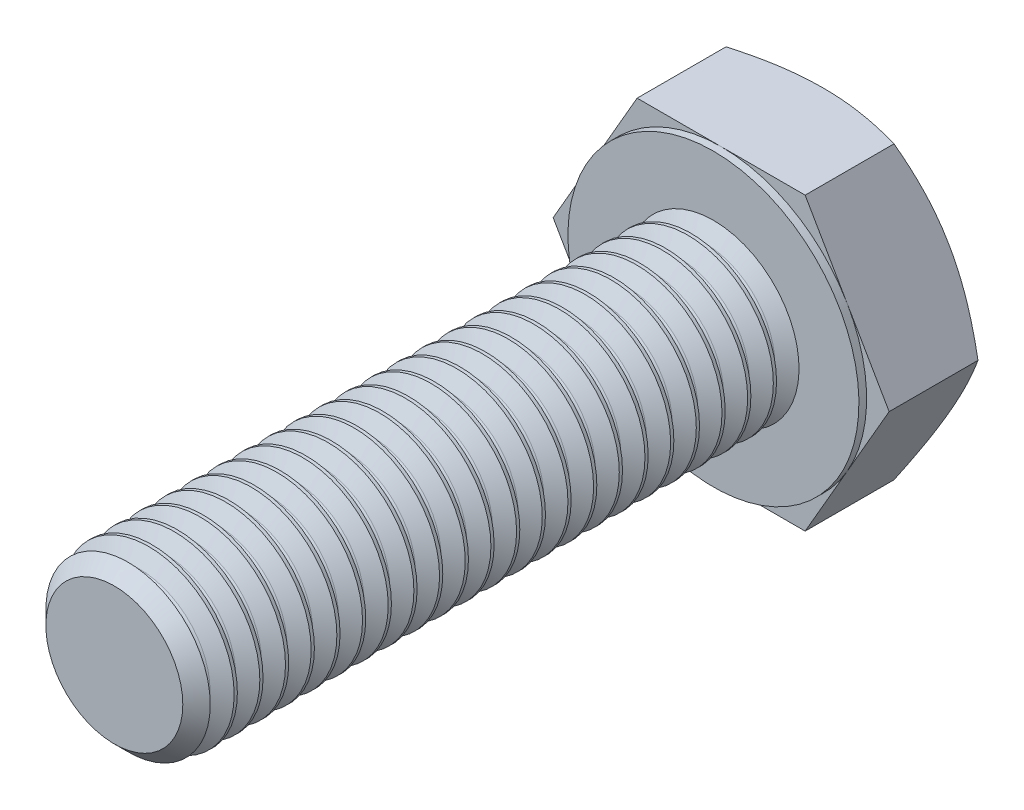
ISO-10303-21;
HEADER;
FILE_DESCRIPTION(('STEP AP214'),'2;1');
FILE_NAME('part.step','',(''),(''),'','','');
FILE_SCHEMA(('AUTOMOTIVE_DESIGN { 1 0 10303 214 1 1 1 1 }'));
ENDSEC;
DATA;
#1=APPLICATION_CONTEXT('core data for automotive mechanical design processes');
#2=APPLICATION_PROTOCOL_DEFINITION('international standard','automotive_design',2000,#1);
#3=PRODUCT_CONTEXT('',#1,'mechanical');
#4=PRODUCT('Part','Part','',(#3));
#5=PRODUCT_RELATED_PRODUCT_CATEGORY('part','',(#4));
#6=PRODUCT_DEFINITION_FORMATION('','',#4);
#7=PRODUCT_DEFINITION_CONTEXT('part definition',#1,'design');
#8=PRODUCT_DEFINITION('design','',#6,#7);
#9=PRODUCT_DEFINITION_SHAPE('','',#8);
#10=(LENGTH_UNIT() NAMED_UNIT(*) SI_UNIT(.MILLI.,.METRE.));
#11=(NAMED_UNIT(*) PLANE_ANGLE_UNIT() SI_UNIT($,.RADIAN.));
#12=(NAMED_UNIT(*) SI_UNIT($,.STERADIAN.) SOLID_ANGLE_UNIT());
#13=UNCERTAINTY_MEASURE_WITH_UNIT(LENGTH_MEASURE(1.E-05),#10,'distance_accuracy_value','');
#14=(GEOMETRIC_REPRESENTATION_CONTEXT(3) GLOBAL_UNCERTAINTY_ASSIGNED_CONTEXT((#13)) GLOBAL_UNIT_ASSIGNED_CONTEXT((#10,
#11,#12)) REPRESENTATION_CONTEXT('',''));
#15=CARTESIAN_POINT('',(0.,0.,0.));
#16=DIRECTION('',(0.,0.,1.));
#17=DIRECTION('',(1.,0.,0.));
#18=AXIS2_PLACEMENT_3D('',#15,#16,#17);
#19=CARTESIAN_POINT('',(0.,-8.5,-0.450000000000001));
#20=DIRECTION('',(0.,0.,1.));
#21=DIRECTION('',(0.,-1.,0.));
#22=AXIS2_PLACEMENT_3D('',#19,#20,#21);
#23=PLANE('',#22);
#24=DIRECTION('',(-0.5,-0.866025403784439,0.));
#25=VECTOR('',#24,1.);
#26=CARTESIAN_POINT('',(-11.0418238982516,-2.12500000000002,-0.449999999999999));
#27=LINE('',#26,#25);
#28=CARTESIAN_POINT('',(-7.36121593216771,4.24999999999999,-0.450000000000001));
#29=VERTEX_POINT('',#28);
#30=CARTESIAN_POINT('',(-9.8149545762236,0.,-0.449999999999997));
#31=VERTEX_POINT('',#30);
#32=EDGE_CURVE('E584',#29,#31,#27,.T.);
#33=ORIENTED_EDGE('',*,*,#32,.T.);
#34=DIRECTION('',(0.5,-0.866025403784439,0.));
#35=VECTOR('',#34,1.);
#36=CARTESIAN_POINT('',(-3.68060796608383,-10.625,-0.450000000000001));
#37=LINE('',#36,#35);
#38=CARTESIAN_POINT('',(-7.36121593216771,-4.24999999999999,-0.450000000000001));
#39=VERTEX_POINT('',#38);
#40=EDGE_CURVE('E625',#31,#39,#37,.T.);
#41=ORIENTED_EDGE('',*,*,#40,.T.);
#42=CARTESIAN_POINT('',(0.,0.,-0.449999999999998));
#43=DIRECTION('',(0.,0.,-1.));
#44=DIRECTION('',(0.,1.,0.));
#45=AXIS2_PLACEMENT_3D('',#42,#43,#44);
#46=CIRCLE('',#45,8.5);
#47=EDGE_CURVE('E620',#39,#29,#46,.T.);
#48=ORIENTED_EDGE('',*,*,#47,.T.);
#49=EDGE_LOOP('',(#33,#41,#48));
#50=FACE_BOUND('',#49,.T.);
#51=ADVANCED_FACE('F34',(#50),#23,.T.);
#52=CARTESIAN_POINT('',(0.,-8.5,-0.450000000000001));
#53=VERTEX_POINT('',#52);
#54=EDGE_CURVE('E545',#53,#39,#46,.T.);
#55=ORIENTED_EDGE('',*,*,#54,.T.);
#56=CARTESIAN_POINT('',(-4.90747728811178,-8.5,-0.45));
#57=VERTEX_POINT('',#56);
#58=EDGE_CURVE('E574',#39,#57,#37,.T.);
#59=ORIENTED_EDGE('',*,*,#58,.T.);
#60=DIRECTION('',(1.,0.,0.));
#61=VECTOR('',#60,1.);
#62=CARTESIAN_POINT('',(0.,-8.5,-0.450000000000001));
#63=LINE('',#62,#61);
#64=EDGE_CURVE('E205',#57,#53,#63,.T.);
#65=ORIENTED_EDGE('',*,*,#64,.T.);
#66=EDGE_LOOP('',(#55,#59,#65));
#67=FACE_BOUND('',#66,.T.);
#68=ADVANCED_FACE('F604',(#67),#23,.T.);
#69=CARTESIAN_POINT('',(7.36121593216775,-4.25000000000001,-0.450000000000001));
#70=VERTEX_POINT('',#69);
#71=EDGE_CURVE('E204',#70,#53,#46,.T.);
#72=ORIENTED_EDGE('',*,*,#71,.T.);
#73=CARTESIAN_POINT('',(4.90747728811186,-8.5,-0.450000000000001));
#74=VERTEX_POINT('',#73);
#75=EDGE_CURVE('E192',#53,#74,#63,.T.);
#76=ORIENTED_EDGE('',*,*,#75,.T.);
#77=DIRECTION('',(0.5,0.866025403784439,0.));
#78=VECTOR('',#77,1.);
#79=CARTESIAN_POINT('',(3.6806079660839,-10.625,-0.450000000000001));
#80=LINE('',#79,#78);
#81=EDGE_CURVE('E202',#74,#70,#80,.T.);
#82=ORIENTED_EDGE('',*,*,#81,.T.);
#83=EDGE_LOOP('',(#72,#76,#82));
#84=FACE_BOUND('',#83,.T.);
#85=ADVANCED_FACE('F201',(#84),#23,.T.);
#86=DIRECTION('',(-1.,0.,0.));
#87=VECTOR('',#86,1.);
#88=CARTESIAN_POINT('',(0.,8.5,-0.449999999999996));
#89=LINE('',#88,#87);
#90=CARTESIAN_POINT('',(0.,8.5,-0.450000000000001));
#91=VERTEX_POINT('',#90);
#92=CARTESIAN_POINT('',(-4.90747728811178,8.5,-0.449999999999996));
#93=VERTEX_POINT('',#92);
#94=EDGE_CURVE('E146',#91,#93,#89,.T.);
#95=ORIENTED_EDGE('',*,*,#94,.T.);
#96=EDGE_CURVE('E587',#93,#29,#27,.T.);
#97=ORIENTED_EDGE('',*,*,#96,.T.);
#98=EDGE_CURVE('E225',#29,#91,#46,.T.);
#99=ORIENTED_EDGE('',*,*,#98,.T.);
#100=EDGE_LOOP('',(#95,#97,#99));
#101=FACE_BOUND('',#100,.T.);
#102=ADVANCED_FACE('F616',(#101),#23,.T.);
#103=CARTESIAN_POINT('',(7.36121593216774,4.25000000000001,-0.450000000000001));
#104=VERTEX_POINT('',#103);
#105=EDGE_CURVE('E232',#104,#70,#46,.T.);
#106=ORIENTED_EDGE('',*,*,#105,.T.);
#107=CARTESIAN_POINT('',(9.81495457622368,0.,-0.449999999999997));
#108=VERTEX_POINT('',#107);
#109=EDGE_CURVE('E221',#70,#108,#80,.T.);
#110=ORIENTED_EDGE('',*,*,#109,.T.);
#111=DIRECTION('',(-0.5,0.866025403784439,0.));
#112=VECTOR('',#111,1.);
#113=CARTESIAN_POINT('',(11.0418238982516,-2.12499999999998,-0.449999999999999));
#114=LINE('',#113,#112);
#115=EDGE_CURVE('E144',#108,#104,#114,.T.);
#116=ORIENTED_EDGE('',*,*,#115,.T.);
#117=EDGE_LOOP('',(#106,#110,#116));
#118=FACE_BOUND('',#117,.T.);
#119=ADVANCED_FACE('F547',(#118),#23,.T.);
#120=CARTESIAN_POINT('',(4.90747728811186,8.5,-0.449999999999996));
#121=VERTEX_POINT('',#120);
#122=EDGE_CURVE('E129',#104,#121,#114,.T.);
#123=ORIENTED_EDGE('',*,*,#122,.T.);
#124=EDGE_CURVE('E136',#121,#91,#89,.T.);
#125=ORIENTED_EDGE('',*,*,#124,.T.);
#126=EDGE_CURVE('E228',#91,#104,#46,.T.);
#127=ORIENTED_EDGE('',*,*,#126,.T.);
#128=EDGE_LOOP('',(#123,#125,#127));
#129=FACE_BOUND('',#128,.T.);
#130=ADVANCED_FACE('F531',(#129),#23,.T.);
#131=CARTESIAN_POINT('',(0.,0.,0.));
#132=DIRECTION('',(0.,0.,-1.));
#133=DIRECTION('',(0.,1.,0.));
#134=AXIS2_PLACEMENT_3D('',#131,#132,#133);
#135=PLANE('',#134);
#136=CARTESIAN_POINT('',(0.,0.,0.));
#137=DIRECTION('',(0.,0.,-1.));
#138=DIRECTION('',(0.,1.,0.));
#139=AXIS2_PLACEMENT_3D('',#136,#137,#138);
#140=CIRCLE('',#139,5.);
#141=CARTESIAN_POINT('',(0.,5.,0.));
#142=VERTEX_POINT('',#141);
#143=EDGE_CURVE('E235',#142,#142,#140,.T.);
#144=ORIENTED_EDGE('',*,*,#143,.T.);
#145=EDGE_LOOP('',(#144));
#146=FACE_BOUND('',#145,.T.);
#147=CARTESIAN_POINT('',(0.,0.,0.));
#148=DIRECTION('',(0.,0.,-1.));
#149=DIRECTION('',(0.,1.,0.));
#150=AXIS2_PLACEMENT_3D('',#147,#148,#149);
#151=CIRCLE('',#150,8.5);
#152=CARTESIAN_POINT('',(0.,8.5,0.));
#153=VERTEX_POINT('',#152);
#154=EDGE_CURVE('E231',#153,#153,#151,.T.);
#155=ORIENTED_EDGE('',*,*,#154,.F.);
#156=EDGE_LOOP('',(#155));
#157=FACE_BOUND('',#156,.T.);
#158=ADVANCED_FACE('F528',(#146,#157),#135,.F.);
#159=CARTESIAN_POINT('',(0.,0.,35.));
#160=DIRECTION('',(0.,0.,1.));
#161=DIRECTION('',(0.,-1.,0.));
#162=AXIS2_PLACEMENT_3D('',#159,#160,#161);
#163=CYLINDRICAL_SURFACE('',#162,5.);
#164=CARTESIAN_POINT('',(0.,0.,1.5));
#165=DIRECTION('',(0.,0.,1.));
#166=DIRECTION('',(1.,0.,0.));
#167=AXIS2_PLACEMENT_3D('',#164,#165,#166);
#168=CIRCLE('',#167,5.);
#169=CARTESIAN_POINT('',(5.,0.,1.5));
#170=VERTEX_POINT('',#169);
#171=EDGE_CURVE('E493',#170,#170,#168,.T.);
#172=ORIENTED_EDGE('',*,*,#171,.F.);
#173=EDGE_LOOP('',(#172));
#174=FACE_BOUND('',#173,.T.);
#175=CARTESIAN_POINT('',(0.,0.,1.3125));
#176=DIRECTION('',(0.,0.,1.));
#177=DIRECTION('',(1.,0.,0.));
#178=AXIS2_PLACEMENT_3D('',#175,#176,#177);
#179=CIRCLE('',#178,5.);
#180=CARTESIAN_POINT('',(5.,0.,1.3125));
#181=VERTEX_POINT('',#180);
#182=EDGE_CURVE('E43',#181,#181,#179,.T.);
#183=ORIENTED_EDGE('',*,*,#182,.T.);
#184=EDGE_LOOP('',(#183));
#185=FACE_BOUND('',#184,.T.);
#186=ADVANCED_FACE('F36',(#174,#185),#163,.T.);
#187=CARTESIAN_POINT('',(0.,0.,0.796875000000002));
#188=DIRECTION('',(0.,0.,1.));
#189=DIRECTION('',(1.,0.,0.));
#190=AXIS2_PLACEMENT_3D('',#187,#188,#189);
#191=CONICAL_SURFACE('',#190,4.1069113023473,1.0471975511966);
#192=ORIENTED_EDGE('',*,*,#182,.F.);
#193=EDGE_LOOP('',(#192));
#194=FACE_BOUND('',#193,.T.);
#195=CARTESIAN_POINT('',(0.,0.,0.796875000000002));
#196=DIRECTION('',(0.,0.,1.));
#197=DIRECTION('',(1.,0.,0.));
#198=AXIS2_PLACEMENT_3D('',#195,#196,#197);
#199=CIRCLE('',#198,4.1069113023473);
#200=CARTESIAN_POINT('',(4.1069113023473,0.,0.796875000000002));
#201=VERTEX_POINT('',#200);
#202=EDGE_CURVE('E499',#201,#201,#199,.T.);
#203=ORIENTED_EDGE('',*,*,#202,.T.);
#204=EDGE_LOOP('',(#203));
#205=FACE_BOUND('',#204,.T.);
#206=ADVANCED_FACE('F509',(#194,#205),#191,.T.);
#207=CARTESIAN_POINT('',(0.,0.,0.));
#208=DIRECTION('',(0.,0.,-1.));
#209=DIRECTION('',(-1.,0.,0.));
#210=AXIS2_PLACEMENT_3D('',#207,#208,#209);
#211=CONICAL_SURFACE('',#210,5.,1.0471975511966);
#212=CARTESIAN_POINT('',(0.,0.,0.515624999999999));
#213=DIRECTION('',(0.,0.,1.));
#214=DIRECTION('',(1.,0.,0.));
#215=AXIS2_PLACEMENT_3D('',#212,#213,#214);
#216=CIRCLE('',#215,4.1069113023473);
#217=CARTESIAN_POINT('',(4.1069113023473,0.,0.515624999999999));
#218=VERTEX_POINT('',#217);
#219=EDGE_CURVE('E502',#218,#218,#216,.T.);
#220=ORIENTED_EDGE('',*,*,#219,.F.);
#221=EDGE_LOOP('',(#220));
#222=FACE_BOUND('',#221,.T.);
#223=ORIENTED_EDGE('',*,*,#143,.F.);
#224=EDGE_LOOP('',(#223));
#225=FACE_BOUND('',#224,.T.);
#226=ADVANCED_FACE('F512',(#222,#225),#211,.T.);
#227=CARTESIAN_POINT('',(0.,0.,0.65625));
#228=DIRECTION('',(0.,0.,1.));
#229=DIRECTION('',(1.,0.,0.));
#230=AXIS2_PLACEMENT_3D('',#227,#228,#229);
#231=TOROIDAL_SURFACE('',#230,4.18810118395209,0.162379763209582);
#232=ORIENTED_EDGE('',*,*,#202,.F.);
#233=EDGE_LOOP('',(#232));
#234=FACE_BOUND('',#233,.T.);
#235=ORIENTED_EDGE('',*,*,#219,.T.);
#236=EDGE_LOOP('',(#235));
#237=FACE_BOUND('',#236,.T.);
#238=ADVANCED_FACE('F516',(#234,#237),#231,.F.);
#239=CARTESIAN_POINT('',(0.,0.,2.296875));
#240=DIRECTION('',(0.,0.,1.));
#241=DIRECTION('',(1.,0.,0.));
#242=AXIS2_PLACEMENT_3D('',#239,#240,#241);
#243=CONICAL_SURFACE('',#242,4.1069113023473,1.0471975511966);
#244=CARTESIAN_POINT('',(0.,0.,2.8125));
#245=DIRECTION('',(0.,0.,1.));
#246=DIRECTION('',(1.,0.,0.));
#247=AXIS2_PLACEMENT_3D('',#244,#245,#246);
#248=CIRCLE('',#247,5.);
#249=CARTESIAN_POINT('',(5.,0.,2.8125));
#250=VERTEX_POINT('',#249);
#251=EDGE_CURVE('E496',#250,#250,#248,.T.);
#252=ORIENTED_EDGE('',*,*,#251,.F.);
#253=EDGE_LOOP('',(#252));
#254=FACE_BOUND('',#253,.T.);
#255=CARTESIAN_POINT('',(0.,0.,2.296875));
#256=DIRECTION('',(0.,0.,1.));
#257=DIRECTION('',(1.,0.,0.));
#258=AXIS2_PLACEMENT_3D('',#255,#256,#257);
#259=CIRCLE('',#258,4.1069113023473);
#260=CARTESIAN_POINT('',(4.1069113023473,0.,2.296875));
#261=VERTEX_POINT('',#260);
#262=EDGE_CURVE('E487',#261,#261,#259,.T.);
#263=ORIENTED_EDGE('',*,*,#262,.T.);
#264=EDGE_LOOP('',(#263));
#265=FACE_BOUND('',#264,.T.);
#266=ADVANCED_FACE('F519',(#254,#265),#243,.T.);
#267=CARTESIAN_POINT('',(0.,0.,1.5));
#268=DIRECTION('',(0.,0.,-1.));
#269=DIRECTION('',(-1.,0.,0.));
#270=AXIS2_PLACEMENT_3D('',#267,#268,#269);
#271=CONICAL_SURFACE('',#270,5.,1.0471975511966);
#272=CARTESIAN_POINT('',(0.,0.,2.015625));
#273=DIRECTION('',(0.,0.,1.));
#274=DIRECTION('',(1.,0.,0.));
#275=AXIS2_PLACEMENT_3D('',#272,#273,#274);
#276=CIRCLE('',#275,4.1069113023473);
#277=CARTESIAN_POINT('',(4.1069113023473,0.,2.015625));
#278=VERTEX_POINT('',#277);
#279=EDGE_CURVE('E490',#278,#278,#276,.T.);
#280=ORIENTED_EDGE('',*,*,#279,.F.);
#281=EDGE_LOOP('',(#280));
#282=FACE_BOUND('',#281,.T.);
#283=ORIENTED_EDGE('',*,*,#171,.T.);
#284=EDGE_LOOP('',(#283));
#285=FACE_BOUND('',#284,.T.);
#286=ADVANCED_FACE('F1598',(#282,#285),#271,.T.);
#287=CARTESIAN_POINT('',(0.,0.,2.15625));
#288=DIRECTION('',(0.,0.,1.));
#289=DIRECTION('',(1.,0.,0.));
#290=AXIS2_PLACEMENT_3D('',#287,#288,#289);
#291=TOROIDAL_SURFACE('',#290,4.18810118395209,0.162379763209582);
#292=ORIENTED_EDGE('',*,*,#262,.F.);
#293=EDGE_LOOP('',(#292));
#294=FACE_BOUND('',#293,.T.);
#295=ORIENTED_EDGE('',*,*,#279,.T.);
#296=EDGE_LOOP('',(#295));
#297=FACE_BOUND('',#296,.T.);
#298=ADVANCED_FACE('F1589',(#294,#297),#291,.F.);
#299=CARTESIAN_POINT('',(0.,0.,3.));
#300=DIRECTION('',(0.,0.,1.));
#301=DIRECTION('',(1.,0.,0.));
#302=AXIS2_PLACEMENT_3D('',#299,#300,#301);
#303=CIRCLE('',#302,5.);
#304=CARTESIAN_POINT('',(5.,0.,3.));
#305=VERTEX_POINT('',#304);
#306=EDGE_CURVE('E481',#305,#305,#303,.T.);
#307=ORIENTED_EDGE('',*,*,#306,.F.);
#308=EDGE_LOOP('',(#307));
#309=FACE_BOUND('',#308,.T.);
#310=ORIENTED_EDGE('',*,*,#251,.T.);
#311=EDGE_LOOP('',(#310));
#312=FACE_BOUND('',#311,.T.);
#313=ADVANCED_FACE('F1552',(#309,#312),#163,.T.);
#314=CARTESIAN_POINT('',(0.,0.,3.796875));
#315=DIRECTION('',(0.,0.,1.));
#316=DIRECTION('',(1.,0.,0.));
#317=AXIS2_PLACEMENT_3D('',#314,#315,#316);
#318=CONICAL_SURFACE('',#317,4.1069113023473,1.0471975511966);
#319=CARTESIAN_POINT('',(0.,0.,4.3125));
#320=DIRECTION('',(0.,0.,1.));
#321=DIRECTION('',(1.,0.,0.));
#322=AXIS2_PLACEMENT_3D('',#319,#320,#321);
#323=CIRCLE('',#322,5.);
#324=CARTESIAN_POINT('',(5.,0.,4.3125));
#325=VERTEX_POINT('',#324);
#326=EDGE_CURVE('E484',#325,#325,#323,.T.);
#327=ORIENTED_EDGE('',*,*,#326,.F.);
#328=EDGE_LOOP('',(#327));
#329=FACE_BOUND('',#328,.T.);
#330=CARTESIAN_POINT('',(0.,0.,3.796875));
#331=DIRECTION('',(0.,0.,1.));
#332=DIRECTION('',(1.,0.,0.));
#333=AXIS2_PLACEMENT_3D('',#330,#331,#332);
#334=CIRCLE('',#333,4.1069113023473);
#335=CARTESIAN_POINT('',(4.1069113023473,0.,3.796875));
#336=VERTEX_POINT('',#335);
#337=EDGE_CURVE('E475',#336,#336,#334,.T.);
#338=ORIENTED_EDGE('',*,*,#337,.T.);
#339=EDGE_LOOP('',(#338));
#340=FACE_BOUND('',#339,.T.);
#341=ADVANCED_FACE('F1570',(#329,#340),#318,.T.);
#342=CARTESIAN_POINT('',(0.,0.,3.));
#343=DIRECTION('',(0.,0.,-1.));
#344=DIRECTION('',(-1.,0.,0.));
#345=AXIS2_PLACEMENT_3D('',#342,#343,#344);
#346=CONICAL_SURFACE('',#345,5.,1.0471975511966);
#347=CARTESIAN_POINT('',(0.,0.,3.515625));
#348=DIRECTION('',(0.,0.,1.));
#349=DIRECTION('',(1.,0.,0.));
#350=AXIS2_PLACEMENT_3D('',#347,#348,#349);
#351=CIRCLE('',#350,4.1069113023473);
#352=CARTESIAN_POINT('',(4.1069113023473,0.,3.515625));
#353=VERTEX_POINT('',#352);
#354=EDGE_CURVE('E478',#353,#353,#351,.T.);
#355=ORIENTED_EDGE('',*,*,#354,.F.);
#356=EDGE_LOOP('',(#355));
#357=FACE_BOUND('',#356,.T.);
#358=ORIENTED_EDGE('',*,*,#306,.T.);
#359=EDGE_LOOP('',(#358));
#360=FACE_BOUND('',#359,.T.);
#361=ADVANCED_FACE('F1560',(#357,#360),#346,.T.);
#362=CARTESIAN_POINT('',(0.,0.,3.65625));
#363=DIRECTION('',(0.,0.,1.));
#364=DIRECTION('',(1.,0.,0.));
#365=AXIS2_PLACEMENT_3D('',#362,#363,#364);
#366=TOROIDAL_SURFACE('',#365,4.18810118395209,0.162379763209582);
#367=ORIENTED_EDGE('',*,*,#337,.F.);
#368=EDGE_LOOP('',(#367));
#369=FACE_BOUND('',#368,.T.);
#370=ORIENTED_EDGE('',*,*,#354,.T.);
#371=EDGE_LOOP('',(#370));
#372=FACE_BOUND('',#371,.T.);
#373=ADVANCED_FACE('F1550',(#369,#372),#366,.F.);
#374=CARTESIAN_POINT('',(0.,0.,4.5));
#375=DIRECTION('',(0.,0.,1.));
#376=DIRECTION('',(1.,0.,0.));
#377=AXIS2_PLACEMENT_3D('',#374,#375,#376);
#378=CIRCLE('',#377,5.);
#379=CARTESIAN_POINT('',(5.,0.,4.5));
#380=VERTEX_POINT('',#379);
#381=EDGE_CURVE('E469',#380,#380,#378,.T.);
#382=ORIENTED_EDGE('',*,*,#381,.F.);
#383=EDGE_LOOP('',(#382));
#384=FACE_BOUND('',#383,.T.);
#385=ORIENTED_EDGE('',*,*,#326,.T.);
#386=EDGE_LOOP('',(#385));
#387=FACE_BOUND('',#386,.T.);
#388=ADVANCED_FACE('F1513',(#384,#387),#163,.T.);
#389=CARTESIAN_POINT('',(0.,0.,5.296875));
#390=DIRECTION('',(0.,0.,1.));
#391=DIRECTION('',(1.,0.,0.));
#392=AXIS2_PLACEMENT_3D('',#389,#390,#391);
#393=CONICAL_SURFACE('',#392,4.1069113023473,1.0471975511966);
#394=CARTESIAN_POINT('',(0.,0.,5.8125));
#395=DIRECTION('',(0.,0.,1.));
#396=DIRECTION('',(1.,0.,0.));
#397=AXIS2_PLACEMENT_3D('',#394,#395,#396);
#398=CIRCLE('',#397,5.);
#399=CARTESIAN_POINT('',(5.,0.,5.8125));
#400=VERTEX_POINT('',#399);
#401=EDGE_CURVE('E472',#400,#400,#398,.T.);
#402=ORIENTED_EDGE('',*,*,#401,.F.);
#403=EDGE_LOOP('',(#402));
#404=FACE_BOUND('',#403,.T.);
#405=CARTESIAN_POINT('',(0.,0.,5.296875));
#406=DIRECTION('',(0.,0.,1.));
#407=DIRECTION('',(1.,0.,0.));
#408=AXIS2_PLACEMENT_3D('',#405,#406,#407);
#409=CIRCLE('',#408,4.1069113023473);
#410=CARTESIAN_POINT('',(4.1069113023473,0.,5.296875));
#411=VERTEX_POINT('',#410);
#412=EDGE_CURVE('E463',#411,#411,#409,.T.);
#413=ORIENTED_EDGE('',*,*,#412,.T.);
#414=EDGE_LOOP('',(#413));
#415=FACE_BOUND('',#414,.T.);
#416=ADVANCED_FACE('F1531',(#404,#415),#393,.T.);
#417=CARTESIAN_POINT('',(0.,0.,4.5));
#418=DIRECTION('',(0.,0.,-1.));
#419=DIRECTION('',(-1.,0.,0.));
#420=AXIS2_PLACEMENT_3D('',#417,#418,#419);
#421=CONICAL_SURFACE('',#420,5.,1.0471975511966);
#422=CARTESIAN_POINT('',(0.,0.,5.015625));
#423=DIRECTION('',(0.,0.,1.));
#424=DIRECTION('',(1.,0.,0.));
#425=AXIS2_PLACEMENT_3D('',#422,#423,#424);
#426=CIRCLE('',#425,4.1069113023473);
#427=CARTESIAN_POINT('',(4.1069113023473,0.,5.015625));
#428=VERTEX_POINT('',#427);
#429=EDGE_CURVE('E466',#428,#428,#426,.T.);
#430=ORIENTED_EDGE('',*,*,#429,.F.);
#431=EDGE_LOOP('',(#430));
#432=FACE_BOUND('',#431,.T.);
#433=ORIENTED_EDGE('',*,*,#381,.T.);
#434=EDGE_LOOP('',(#433));
#435=FACE_BOUND('',#434,.T.);
#436=ADVANCED_FACE('F1521',(#432,#435),#421,.T.);
#437=CARTESIAN_POINT('',(0.,0.,5.15625));
#438=DIRECTION('',(0.,0.,1.));
#439=DIRECTION('',(1.,0.,0.));
#440=AXIS2_PLACEMENT_3D('',#437,#438,#439);
#441=TOROIDAL_SURFACE('',#440,4.18810118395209,0.162379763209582);
#442=ORIENTED_EDGE('',*,*,#412,.F.);
#443=EDGE_LOOP('',(#442));
#444=FACE_BOUND('',#443,.T.);
#445=ORIENTED_EDGE('',*,*,#429,.T.);
#446=EDGE_LOOP('',(#445));
#447=FACE_BOUND('',#446,.T.);
#448=ADVANCED_FACE('F1511',(#444,#447),#441,.F.);
#449=CARTESIAN_POINT('',(0.,0.,6.));
#450=DIRECTION('',(0.,0.,1.));
#451=DIRECTION('',(1.,0.,0.));
#452=AXIS2_PLACEMENT_3D('',#449,#450,#451);
#453=CIRCLE('',#452,5.);
#454=CARTESIAN_POINT('',(5.,0.,6.));
#455=VERTEX_POINT('',#454);
#456=EDGE_CURVE('E457',#455,#455,#453,.T.);
#457=ORIENTED_EDGE('',*,*,#456,.F.);
#458=EDGE_LOOP('',(#457));
#459=FACE_BOUND('',#458,.T.);
#460=ORIENTED_EDGE('',*,*,#401,.T.);
#461=EDGE_LOOP('',(#460));
#462=FACE_BOUND('',#461,.T.);
#463=ADVANCED_FACE('F1474',(#459,#462),#163,.T.);
#464=CARTESIAN_POINT('',(0.,0.,6.796875));
#465=DIRECTION('',(0.,0.,1.));
#466=DIRECTION('',(1.,0.,0.));
#467=AXIS2_PLACEMENT_3D('',#464,#465,#466);
#468=CONICAL_SURFACE('',#467,4.1069113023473,1.0471975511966);
#469=CARTESIAN_POINT('',(0.,0.,7.3125));
#470=DIRECTION('',(0.,0.,1.));
#471=DIRECTION('',(1.,0.,0.));
#472=AXIS2_PLACEMENT_3D('',#469,#470,#471);
#473=CIRCLE('',#472,5.);
#474=CARTESIAN_POINT('',(5.,0.,7.3125));
#475=VERTEX_POINT('',#474);
#476=EDGE_CURVE('E460',#475,#475,#473,.T.);
#477=ORIENTED_EDGE('',*,*,#476,.F.);
#478=EDGE_LOOP('',(#477));
#479=FACE_BOUND('',#478,.T.);
#480=CARTESIAN_POINT('',(0.,0.,6.796875));
#481=DIRECTION('',(0.,0.,1.));
#482=DIRECTION('',(1.,0.,0.));
#483=AXIS2_PLACEMENT_3D('',#480,#481,#482);
#484=CIRCLE('',#483,4.1069113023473);
#485=CARTESIAN_POINT('',(4.1069113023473,0.,6.796875));
#486=VERTEX_POINT('',#485);
#487=EDGE_CURVE('E451',#486,#486,#484,.T.);
#488=ORIENTED_EDGE('',*,*,#487,.T.);
#489=EDGE_LOOP('',(#488));
#490=FACE_BOUND('',#489,.T.);
#491=ADVANCED_FACE('F1492',(#479,#490),#468,.T.);
#492=CARTESIAN_POINT('',(0.,0.,6.));
#493=DIRECTION('',(0.,0.,-1.));
#494=DIRECTION('',(-1.,0.,0.));
#495=AXIS2_PLACEMENT_3D('',#492,#493,#494);
#496=CONICAL_SURFACE('',#495,5.,1.0471975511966);
#497=CARTESIAN_POINT('',(0.,0.,6.515625));
#498=DIRECTION('',(0.,0.,1.));
#499=DIRECTION('',(1.,0.,0.));
#500=AXIS2_PLACEMENT_3D('',#497,#498,#499);
#501=CIRCLE('',#500,4.1069113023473);
#502=CARTESIAN_POINT('',(4.1069113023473,0.,6.515625));
#503=VERTEX_POINT('',#502);
#504=EDGE_CURVE('E454',#503,#503,#501,.T.);
#505=ORIENTED_EDGE('',*,*,#504,.F.);
#506=EDGE_LOOP('',(#505));
#507=FACE_BOUND('',#506,.T.);
#508=ORIENTED_EDGE('',*,*,#456,.T.);
#509=EDGE_LOOP('',(#508));
#510=FACE_BOUND('',#509,.T.);
#511=ADVANCED_FACE('F1482',(#507,#510),#496,.T.);
#512=CARTESIAN_POINT('',(0.,0.,6.65625));
#513=DIRECTION('',(0.,0.,1.));
#514=DIRECTION('',(1.,0.,0.));
#515=AXIS2_PLACEMENT_3D('',#512,#513,#514);
#516=TOROIDAL_SURFACE('',#515,4.18810118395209,0.162379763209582);
#517=ORIENTED_EDGE('',*,*,#487,.F.);
#518=EDGE_LOOP('',(#517));
#519=FACE_BOUND('',#518,.T.);
#520=ORIENTED_EDGE('',*,*,#504,.T.);
#521=EDGE_LOOP('',(#520));
#522=FACE_BOUND('',#521,.T.);
#523=ADVANCED_FACE('F1472',(#519,#522),#516,.F.);
#524=CARTESIAN_POINT('',(0.,0.,7.5));
#525=DIRECTION('',(0.,0.,1.));
#526=DIRECTION('',(1.,0.,0.));
#527=AXIS2_PLACEMENT_3D('',#524,#525,#526);
#528=CIRCLE('',#527,5.);
#529=CARTESIAN_POINT('',(5.,0.,7.5));
#530=VERTEX_POINT('',#529);
#531=EDGE_CURVE('E445',#530,#530,#528,.T.);
#532=ORIENTED_EDGE('',*,*,#531,.F.);
#533=EDGE_LOOP('',(#532));
#534=FACE_BOUND('',#533,.T.);
#535=ORIENTED_EDGE('',*,*,#476,.T.);
#536=EDGE_LOOP('',(#535));
#537=FACE_BOUND('',#536,.T.);
#538=ADVANCED_FACE('F1435',(#534,#537),#163,.T.);
#539=CARTESIAN_POINT('',(0.,0.,8.296875));
#540=DIRECTION('',(0.,0.,1.));
#541=DIRECTION('',(1.,0.,0.));
#542=AXIS2_PLACEMENT_3D('',#539,#540,#541);
#543=CONICAL_SURFACE('',#542,4.1069113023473,1.0471975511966);
#544=CARTESIAN_POINT('',(0.,0.,8.8125));
#545=DIRECTION('',(0.,0.,1.));
#546=DIRECTION('',(1.,0.,0.));
#547=AXIS2_PLACEMENT_3D('',#544,#545,#546);
#548=CIRCLE('',#547,5.);
#549=CARTESIAN_POINT('',(5.,0.,8.8125));
#550=VERTEX_POINT('',#549);
#551=EDGE_CURVE('E448',#550,#550,#548,.T.);
#552=ORIENTED_EDGE('',*,*,#551,.F.);
#553=EDGE_LOOP('',(#552));
#554=FACE_BOUND('',#553,.T.);
#555=CARTESIAN_POINT('',(0.,0.,8.296875));
#556=DIRECTION('',(0.,0.,1.));
#557=DIRECTION('',(1.,0.,0.));
#558=AXIS2_PLACEMENT_3D('',#555,#556,#557);
#559=CIRCLE('',#558,4.1069113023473);
#560=CARTESIAN_POINT('',(4.1069113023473,0.,8.296875));
#561=VERTEX_POINT('',#560);
#562=EDGE_CURVE('E439',#561,#561,#559,.T.);
#563=ORIENTED_EDGE('',*,*,#562,.T.);
#564=EDGE_LOOP('',(#563));
#565=FACE_BOUND('',#564,.T.);
#566=ADVANCED_FACE('F1453',(#554,#565),#543,.T.);
#567=CARTESIAN_POINT('',(0.,0.,7.5));
#568=DIRECTION('',(0.,0.,-1.));
#569=DIRECTION('',(-1.,0.,0.));
#570=AXIS2_PLACEMENT_3D('',#567,#568,#569);
#571=CONICAL_SURFACE('',#570,5.,1.0471975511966);
#572=CARTESIAN_POINT('',(0.,0.,8.015625));
#573=DIRECTION('',(0.,0.,1.));
#574=DIRECTION('',(1.,0.,0.));
#575=AXIS2_PLACEMENT_3D('',#572,#573,#574);
#576=CIRCLE('',#575,4.1069113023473);
#577=CARTESIAN_POINT('',(4.1069113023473,0.,8.015625));
#578=VERTEX_POINT('',#577);
#579=EDGE_CURVE('E442',#578,#578,#576,.T.);
#580=ORIENTED_EDGE('',*,*,#579,.F.);
#581=EDGE_LOOP('',(#580));
#582=FACE_BOUND('',#581,.T.);
#583=ORIENTED_EDGE('',*,*,#531,.T.);
#584=EDGE_LOOP('',(#583));
#585=FACE_BOUND('',#584,.T.);
#586=ADVANCED_FACE('F1443',(#582,#585),#571,.T.);
#587=CARTESIAN_POINT('',(0.,0.,8.15625));
#588=DIRECTION('',(0.,0.,1.));
#589=DIRECTION('',(1.,0.,0.));
#590=AXIS2_PLACEMENT_3D('',#587,#588,#589);
#591=TOROIDAL_SURFACE('',#590,4.18810118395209,0.162379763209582);
#592=ORIENTED_EDGE('',*,*,#562,.F.);
#593=EDGE_LOOP('',(#592));
#594=FACE_BOUND('',#593,.T.);
#595=ORIENTED_EDGE('',*,*,#579,.T.);
#596=EDGE_LOOP('',(#595));
#597=FACE_BOUND('',#596,.T.);
#598=ADVANCED_FACE('F1433',(#594,#597),#591,.F.);
#599=CARTESIAN_POINT('',(0.,0.,9.));
#600=DIRECTION('',(0.,0.,1.));
#601=DIRECTION('',(1.,0.,0.));
#602=AXIS2_PLACEMENT_3D('',#599,#600,#601);
#603=CIRCLE('',#602,5.);
#604=CARTESIAN_POINT('',(5.,0.,9.));
#605=VERTEX_POINT('',#604);
#606=EDGE_CURVE('E433',#605,#605,#603,.T.);
#607=ORIENTED_EDGE('',*,*,#606,.F.);
#608=EDGE_LOOP('',(#607));
#609=FACE_BOUND('',#608,.T.);
#610=ORIENTED_EDGE('',*,*,#551,.T.);
#611=EDGE_LOOP('',(#610));
#612=FACE_BOUND('',#611,.T.);
#613=ADVANCED_FACE('F1396',(#609,#612),#163,.T.);
#614=CARTESIAN_POINT('',(0.,0.,9.796875));
#615=DIRECTION('',(0.,0.,1.));
#616=DIRECTION('',(1.,0.,0.));
#617=AXIS2_PLACEMENT_3D('',#614,#615,#616);
#618=CONICAL_SURFACE('',#617,4.1069113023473,1.0471975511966);
#619=CARTESIAN_POINT('',(0.,0.,10.3125));
#620=DIRECTION('',(0.,0.,1.));
#621=DIRECTION('',(1.,0.,0.));
#622=AXIS2_PLACEMENT_3D('',#619,#620,#621);
#623=CIRCLE('',#622,5.);
#624=CARTESIAN_POINT('',(5.,0.,10.3125));
#625=VERTEX_POINT('',#624);
#626=EDGE_CURVE('E436',#625,#625,#623,.T.);
#627=ORIENTED_EDGE('',*,*,#626,.F.);
#628=EDGE_LOOP('',(#627));
#629=FACE_BOUND('',#628,.T.);
#630=CARTESIAN_POINT('',(0.,0.,9.796875));
#631=DIRECTION('',(0.,0.,1.));
#632=DIRECTION('',(1.,0.,0.));
#633=AXIS2_PLACEMENT_3D('',#630,#631,#632);
#634=CIRCLE('',#633,4.1069113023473);
#635=CARTESIAN_POINT('',(4.1069113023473,0.,9.796875));
#636=VERTEX_POINT('',#635);
#637=EDGE_CURVE('E427',#636,#636,#634,.T.);
#638=ORIENTED_EDGE('',*,*,#637,.T.);
#639=EDGE_LOOP('',(#638));
#640=FACE_BOUND('',#639,.T.);
#641=ADVANCED_FACE('F1414',(#629,#640),#618,.T.);
#642=CARTESIAN_POINT('',(0.,0.,9.));
#643=DIRECTION('',(0.,0.,-1.));
#644=DIRECTION('',(-1.,0.,0.));
#645=AXIS2_PLACEMENT_3D('',#642,#643,#644);
#646=CONICAL_SURFACE('',#645,5.,1.0471975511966);
#647=CARTESIAN_POINT('',(0.,0.,9.515625));
#648=DIRECTION('',(0.,0.,1.));
#649=DIRECTION('',(1.,0.,0.));
#650=AXIS2_PLACEMENT_3D('',#647,#648,#649);
#651=CIRCLE('',#650,4.1069113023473);
#652=CARTESIAN_POINT('',(4.1069113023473,0.,9.515625));
#653=VERTEX_POINT('',#652);
#654=EDGE_CURVE('E430',#653,#653,#651,.T.);
#655=ORIENTED_EDGE('',*,*,#654,.F.);
#656=EDGE_LOOP('',(#655));
#657=FACE_BOUND('',#656,.T.);
#658=ORIENTED_EDGE('',*,*,#606,.T.);
#659=EDGE_LOOP('',(#658));
#660=FACE_BOUND('',#659,.T.);
#661=ADVANCED_FACE('F1404',(#657,#660),#646,.T.);
#662=CARTESIAN_POINT('',(0.,0.,9.65625));
#663=DIRECTION('',(0.,0.,1.));
#664=DIRECTION('',(1.,0.,0.));
#665=AXIS2_PLACEMENT_3D('',#662,#663,#664);
#666=TOROIDAL_SURFACE('',#665,4.18810118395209,0.162379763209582);
#667=ORIENTED_EDGE('',*,*,#637,.F.);
#668=EDGE_LOOP('',(#667));
#669=FACE_BOUND('',#668,.T.);
#670=ORIENTED_EDGE('',*,*,#654,.T.);
#671=EDGE_LOOP('',(#670));
#672=FACE_BOUND('',#671,.T.);
#673=ADVANCED_FACE('F1394',(#669,#672),#666,.F.);
#674=CARTESIAN_POINT('',(0.,0.,10.5));
#675=DIRECTION('',(0.,0.,1.));
#676=DIRECTION('',(1.,0.,0.));
#677=AXIS2_PLACEMENT_3D('',#674,#675,#676);
#678=CIRCLE('',#677,5.);
#679=CARTESIAN_POINT('',(5.,0.,10.5));
#680=VERTEX_POINT('',#679);
#681=EDGE_CURVE('E421',#680,#680,#678,.T.);
#682=ORIENTED_EDGE('',*,*,#681,.F.);
#683=EDGE_LOOP('',(#682));
#684=FACE_BOUND('',#683,.T.);
#685=ORIENTED_EDGE('',*,*,#626,.T.);
#686=EDGE_LOOP('',(#685));
#687=FACE_BOUND('',#686,.T.);
#688=ADVANCED_FACE('F1357',(#684,#687),#163,.T.);
#689=CARTESIAN_POINT('',(0.,0.,11.296875));
#690=DIRECTION('',(0.,0.,1.));
#691=DIRECTION('',(1.,0.,0.));
#692=AXIS2_PLACEMENT_3D('',#689,#690,#691);
#693=CONICAL_SURFACE('',#692,4.1069113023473,1.0471975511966);
#694=CARTESIAN_POINT('',(0.,0.,11.8125));
#695=DIRECTION('',(0.,0.,1.));
#696=DIRECTION('',(1.,0.,0.));
#697=AXIS2_PLACEMENT_3D('',#694,#695,#696);
#698=CIRCLE('',#697,5.);
#699=CARTESIAN_POINT('',(5.,0.,11.8125));
#700=VERTEX_POINT('',#699);
#701=EDGE_CURVE('E424',#700,#700,#698,.T.);
#702=ORIENTED_EDGE('',*,*,#701,.F.);
#703=EDGE_LOOP('',(#702));
#704=FACE_BOUND('',#703,.T.);
#705=CARTESIAN_POINT('',(0.,0.,11.296875));
#706=DIRECTION('',(0.,0.,1.));
#707=DIRECTION('',(1.,0.,0.));
#708=AXIS2_PLACEMENT_3D('',#705,#706,#707);
#709=CIRCLE('',#708,4.1069113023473);
#710=CARTESIAN_POINT('',(4.1069113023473,0.,11.296875));
#711=VERTEX_POINT('',#710);
#712=EDGE_CURVE('E415',#711,#711,#709,.T.);
#713=ORIENTED_EDGE('',*,*,#712,.T.);
#714=EDGE_LOOP('',(#713));
#715=FACE_BOUND('',#714,.T.);
#716=ADVANCED_FACE('F1375',(#704,#715),#693,.T.);
#717=CARTESIAN_POINT('',(0.,0.,10.5));
#718=DIRECTION('',(0.,0.,-1.));
#719=DIRECTION('',(-1.,0.,0.));
#720=AXIS2_PLACEMENT_3D('',#717,#718,#719);
#721=CONICAL_SURFACE('',#720,5.,1.0471975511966);
#722=CARTESIAN_POINT('',(0.,0.,11.015625));
#723=DIRECTION('',(0.,0.,1.));
#724=DIRECTION('',(1.,0.,0.));
#725=AXIS2_PLACEMENT_3D('',#722,#723,#724);
#726=CIRCLE('',#725,4.1069113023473);
#727=CARTESIAN_POINT('',(4.1069113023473,0.,11.015625));
#728=VERTEX_POINT('',#727);
#729=EDGE_CURVE('E418',#728,#728,#726,.T.);
#730=ORIENTED_EDGE('',*,*,#729,.F.);
#731=EDGE_LOOP('',(#730));
#732=FACE_BOUND('',#731,.T.);
#733=ORIENTED_EDGE('',*,*,#681,.T.);
#734=EDGE_LOOP('',(#733));
#735=FACE_BOUND('',#734,.T.);
#736=ADVANCED_FACE('F1365',(#732,#735),#721,.T.);
#737=CARTESIAN_POINT('',(0.,0.,11.15625));
#738=DIRECTION('',(0.,0.,1.));
#739=DIRECTION('',(1.,0.,0.));
#740=AXIS2_PLACEMENT_3D('',#737,#738,#739);
#741=TOROIDAL_SURFACE('',#740,4.18810118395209,0.162379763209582);
#742=ORIENTED_EDGE('',*,*,#712,.F.);
#743=EDGE_LOOP('',(#742));
#744=FACE_BOUND('',#743,.T.);
#745=ORIENTED_EDGE('',*,*,#729,.T.);
#746=EDGE_LOOP('',(#745));
#747=FACE_BOUND('',#746,.T.);
#748=ADVANCED_FACE('F1355',(#744,#747),#741,.F.);
#749=CARTESIAN_POINT('',(0.,0.,12.));
#750=DIRECTION('',(0.,0.,1.));
#751=DIRECTION('',(1.,0.,0.));
#752=AXIS2_PLACEMENT_3D('',#749,#750,#751);
#753=CIRCLE('',#752,5.);
#754=CARTESIAN_POINT('',(5.,0.,12.));
#755=VERTEX_POINT('',#754);
#756=EDGE_CURVE('E409',#755,#755,#753,.T.);
#757=ORIENTED_EDGE('',*,*,#756,.F.);
#758=EDGE_LOOP('',(#757));
#759=FACE_BOUND('',#758,.T.);
#760=ORIENTED_EDGE('',*,*,#701,.T.);
#761=EDGE_LOOP('',(#760));
#762=FACE_BOUND('',#761,.T.);
#763=ADVANCED_FACE('F1318',(#759,#762),#163,.T.);
#764=CARTESIAN_POINT('',(0.,0.,12.796875));
#765=DIRECTION('',(0.,0.,1.));
#766=DIRECTION('',(1.,0.,0.));
#767=AXIS2_PLACEMENT_3D('',#764,#765,#766);
#768=CONICAL_SURFACE('',#767,4.1069113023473,1.0471975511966);
#769=CARTESIAN_POINT('',(0.,0.,13.3125));
#770=DIRECTION('',(0.,0.,1.));
#771=DIRECTION('',(1.,0.,0.));
#772=AXIS2_PLACEMENT_3D('',#769,#770,#771);
#773=CIRCLE('',#772,5.);
#774=CARTESIAN_POINT('',(5.,0.,13.3125));
#775=VERTEX_POINT('',#774);
#776=EDGE_CURVE('E412',#775,#775,#773,.T.);
#777=ORIENTED_EDGE('',*,*,#776,.F.);
#778=EDGE_LOOP('',(#777));
#779=FACE_BOUND('',#778,.T.);
#780=CARTESIAN_POINT('',(0.,0.,12.796875));
#781=DIRECTION('',(0.,0.,1.));
#782=DIRECTION('',(1.,0.,0.));
#783=AXIS2_PLACEMENT_3D('',#780,#781,#782);
#784=CIRCLE('',#783,4.1069113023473);
#785=CARTESIAN_POINT('',(4.1069113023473,0.,12.796875));
#786=VERTEX_POINT('',#785);
#787=EDGE_CURVE('E403',#786,#786,#784,.T.);
#788=ORIENTED_EDGE('',*,*,#787,.T.);
#789=EDGE_LOOP('',(#788));
#790=FACE_BOUND('',#789,.T.);
#791=ADVANCED_FACE('F1336',(#779,#790),#768,.T.);
#792=CARTESIAN_POINT('',(0.,0.,12.));
#793=DIRECTION('',(0.,0.,-1.));
#794=DIRECTION('',(-1.,0.,0.));
#795=AXIS2_PLACEMENT_3D('',#792,#793,#794);
#796=CONICAL_SURFACE('',#795,5.,1.0471975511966);
#797=CARTESIAN_POINT('',(0.,0.,12.515625));
#798=DIRECTION('',(0.,0.,1.));
#799=DIRECTION('',(1.,0.,0.));
#800=AXIS2_PLACEMENT_3D('',#797,#798,#799);
#801=CIRCLE('',#800,4.1069113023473);
#802=CARTESIAN_POINT('',(4.1069113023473,0.,12.515625));
#803=VERTEX_POINT('',#802);
#804=EDGE_CURVE('E406',#803,#803,#801,.T.);
#805=ORIENTED_EDGE('',*,*,#804,.F.);
#806=EDGE_LOOP('',(#805));
#807=FACE_BOUND('',#806,.T.);
#808=ORIENTED_EDGE('',*,*,#756,.T.);
#809=EDGE_LOOP('',(#808));
#810=FACE_BOUND('',#809,.T.);
#811=ADVANCED_FACE('F1326',(#807,#810),#796,.T.);
#812=CARTESIAN_POINT('',(0.,0.,12.65625));
#813=DIRECTION('',(0.,0.,1.));
#814=DIRECTION('',(1.,0.,0.));
#815=AXIS2_PLACEMENT_3D('',#812,#813,#814);
#816=TOROIDAL_SURFACE('',#815,4.18810118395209,0.162379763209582);
#817=ORIENTED_EDGE('',*,*,#787,.F.);
#818=EDGE_LOOP('',(#817));
#819=FACE_BOUND('',#818,.T.);
#820=ORIENTED_EDGE('',*,*,#804,.T.);
#821=EDGE_LOOP('',(#820));
#822=FACE_BOUND('',#821,.T.);
#823=ADVANCED_FACE('F1316',(#819,#822),#816,.F.);
#824=CARTESIAN_POINT('',(0.,0.,13.5));
#825=DIRECTION('',(0.,0.,1.));
#826=DIRECTION('',(1.,0.,0.));
#827=AXIS2_PLACEMENT_3D('',#824,#825,#826);
#828=CIRCLE('',#827,5.);
#829=CARTESIAN_POINT('',(5.,0.,13.5));
#830=VERTEX_POINT('',#829);
#831=EDGE_CURVE('E397',#830,#830,#828,.T.);
#832=ORIENTED_EDGE('',*,*,#831,.F.);
#833=EDGE_LOOP('',(#832));
#834=FACE_BOUND('',#833,.T.);
#835=ORIENTED_EDGE('',*,*,#776,.T.);
#836=EDGE_LOOP('',(#835));
#837=FACE_BOUND('',#836,.T.);
#838=ADVANCED_FACE('F1279',(#834,#837),#163,.T.);
#839=CARTESIAN_POINT('',(0.,0.,14.296875));
#840=DIRECTION('',(0.,0.,1.));
#841=DIRECTION('',(1.,0.,0.));
#842=AXIS2_PLACEMENT_3D('',#839,#840,#841);
#843=CONICAL_SURFACE('',#842,4.1069113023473,1.0471975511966);
#844=CARTESIAN_POINT('',(0.,0.,14.8125));
#845=DIRECTION('',(0.,0.,1.));
#846=DIRECTION('',(1.,0.,0.));
#847=AXIS2_PLACEMENT_3D('',#844,#845,#846);
#848=CIRCLE('',#847,5.);
#849=CARTESIAN_POINT('',(5.,0.,14.8125));
#850=VERTEX_POINT('',#849);
#851=EDGE_CURVE('E400',#850,#850,#848,.T.);
#852=ORIENTED_EDGE('',*,*,#851,.F.);
#853=EDGE_LOOP('',(#852));
#854=FACE_BOUND('',#853,.T.);
#855=CARTESIAN_POINT('',(0.,0.,14.296875));
#856=DIRECTION('',(0.,0.,1.));
#857=DIRECTION('',(1.,0.,0.));
#858=AXIS2_PLACEMENT_3D('',#855,#856,#857);
#859=CIRCLE('',#858,4.1069113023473);
#860=CARTESIAN_POINT('',(4.1069113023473,0.,14.296875));
#861=VERTEX_POINT('',#860);
#862=EDGE_CURVE('E391',#861,#861,#859,.T.);
#863=ORIENTED_EDGE('',*,*,#862,.T.);
#864=EDGE_LOOP('',(#863));
#865=FACE_BOUND('',#864,.T.);
#866=ADVANCED_FACE('F1297',(#854,#865),#843,.T.);
#867=CARTESIAN_POINT('',(0.,0.,13.5));
#868=DIRECTION('',(0.,0.,-1.));
#869=DIRECTION('',(-1.,0.,0.));
#870=AXIS2_PLACEMENT_3D('',#867,#868,#869);
#871=CONICAL_SURFACE('',#870,5.,1.0471975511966);
#872=CARTESIAN_POINT('',(0.,0.,14.015625));
#873=DIRECTION('',(0.,0.,1.));
#874=DIRECTION('',(1.,0.,0.));
#875=AXIS2_PLACEMENT_3D('',#872,#873,#874);
#876=CIRCLE('',#875,4.1069113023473);
#877=CARTESIAN_POINT('',(4.1069113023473,0.,14.015625));
#878=VERTEX_POINT('',#877);
#879=EDGE_CURVE('E394',#878,#878,#876,.T.);
#880=ORIENTED_EDGE('',*,*,#879,.F.);
#881=EDGE_LOOP('',(#880));
#882=FACE_BOUND('',#881,.T.);
#883=ORIENTED_EDGE('',*,*,#831,.T.);
#884=EDGE_LOOP('',(#883));
#885=FACE_BOUND('',#884,.T.);
#886=ADVANCED_FACE('F1287',(#882,#885),#871,.T.);
#887=CARTESIAN_POINT('',(0.,0.,14.15625));
#888=DIRECTION('',(0.,0.,1.));
#889=DIRECTION('',(1.,0.,0.));
#890=AXIS2_PLACEMENT_3D('',#887,#888,#889);
#891=TOROIDAL_SURFACE('',#890,4.18810118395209,0.162379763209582);
#892=ORIENTED_EDGE('',*,*,#862,.F.);
#893=EDGE_LOOP('',(#892));
#894=FACE_BOUND('',#893,.T.);
#895=ORIENTED_EDGE('',*,*,#879,.T.);
#896=EDGE_LOOP('',(#895));
#897=FACE_BOUND('',#896,.T.);
#898=ADVANCED_FACE('F1277',(#894,#897),#891,.F.);
#899=CARTESIAN_POINT('',(0.,0.,15.));
#900=DIRECTION('',(0.,0.,1.));
#901=DIRECTION('',(1.,0.,0.));
#902=AXIS2_PLACEMENT_3D('',#899,#900,#901);
#903=CIRCLE('',#902,5.);
#904=CARTESIAN_POINT('',(5.,0.,15.));
#905=VERTEX_POINT('',#904);
#906=EDGE_CURVE('E385',#905,#905,#903,.T.);
#907=ORIENTED_EDGE('',*,*,#906,.F.);
#908=EDGE_LOOP('',(#907));
#909=FACE_BOUND('',#908,.T.);
#910=ORIENTED_EDGE('',*,*,#851,.T.);
#911=EDGE_LOOP('',(#910));
#912=FACE_BOUND('',#911,.T.);
#913=ADVANCED_FACE('F1240',(#909,#912),#163,.T.);
#914=CARTESIAN_POINT('',(0.,0.,15.796875));
#915=DIRECTION('',(0.,0.,1.));
#916=DIRECTION('',(1.,0.,0.));
#917=AXIS2_PLACEMENT_3D('',#914,#915,#916);
#918=CONICAL_SURFACE('',#917,4.1069113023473,1.0471975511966);
#919=CARTESIAN_POINT('',(0.,0.,16.3125));
#920=DIRECTION('',(0.,0.,1.));
#921=DIRECTION('',(1.,0.,0.));
#922=AXIS2_PLACEMENT_3D('',#919,#920,#921);
#923=CIRCLE('',#922,5.);
#924=CARTESIAN_POINT('',(5.,0.,16.3125));
#925=VERTEX_POINT('',#924);
#926=EDGE_CURVE('E388',#925,#925,#923,.T.);
#927=ORIENTED_EDGE('',*,*,#926,.F.);
#928=EDGE_LOOP('',(#927));
#929=FACE_BOUND('',#928,.T.);
#930=CARTESIAN_POINT('',(0.,0.,15.796875));
#931=DIRECTION('',(0.,0.,1.));
#932=DIRECTION('',(1.,0.,0.));
#933=AXIS2_PLACEMENT_3D('',#930,#931,#932);
#934=CIRCLE('',#933,4.1069113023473);
#935=CARTESIAN_POINT('',(4.1069113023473,0.,15.796875));
#936=VERTEX_POINT('',#935);
#937=EDGE_CURVE('E379',#936,#936,#934,.T.);
#938=ORIENTED_EDGE('',*,*,#937,.T.);
#939=EDGE_LOOP('',(#938));
#940=FACE_BOUND('',#939,.T.);
#941=ADVANCED_FACE('F1258',(#929,#940),#918,.T.);
#942=CARTESIAN_POINT('',(0.,0.,15.));
#943=DIRECTION('',(0.,0.,-1.));
#944=DIRECTION('',(-1.,0.,0.));
#945=AXIS2_PLACEMENT_3D('',#942,#943,#944);
#946=CONICAL_SURFACE('',#945,5.,1.0471975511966);
#947=CARTESIAN_POINT('',(0.,0.,15.515625));
#948=DIRECTION('',(0.,0.,1.));
#949=DIRECTION('',(1.,0.,0.));
#950=AXIS2_PLACEMENT_3D('',#947,#948,#949);
#951=CIRCLE('',#950,4.1069113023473);
#952=CARTESIAN_POINT('',(4.1069113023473,0.,15.515625));
#953=VERTEX_POINT('',#952);
#954=EDGE_CURVE('E382',#953,#953,#951,.T.);
#955=ORIENTED_EDGE('',*,*,#954,.F.);
#956=EDGE_LOOP('',(#955));
#957=FACE_BOUND('',#956,.T.);
#958=ORIENTED_EDGE('',*,*,#906,.T.);
#959=EDGE_LOOP('',(#958));
#960=FACE_BOUND('',#959,.T.);
#961=ADVANCED_FACE('F1248',(#957,#960),#946,.T.);
#962=CARTESIAN_POINT('',(0.,0.,15.65625));
#963=DIRECTION('',(0.,0.,1.));
#964=DIRECTION('',(1.,0.,0.));
#965=AXIS2_PLACEMENT_3D('',#962,#963,#964);
#966=TOROIDAL_SURFACE('',#965,4.18810118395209,0.162379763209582);
#967=ORIENTED_EDGE('',*,*,#937,.F.);
#968=EDGE_LOOP('',(#967));
#969=FACE_BOUND('',#968,.T.);
#970=ORIENTED_EDGE('',*,*,#954,.T.);
#971=EDGE_LOOP('',(#970));
#972=FACE_BOUND('',#971,.T.);
#973=ADVANCED_FACE('F1238',(#969,#972),#966,.F.);
#974=CARTESIAN_POINT('',(0.,0.,16.5));
#975=DIRECTION('',(0.,0.,1.));
#976=DIRECTION('',(1.,0.,0.));
#977=AXIS2_PLACEMENT_3D('',#974,#975,#976);
#978=CIRCLE('',#977,5.);
#979=CARTESIAN_POINT('',(5.,0.,16.5));
#980=VERTEX_POINT('',#979);
#981=EDGE_CURVE('E373',#980,#980,#978,.T.);
#982=ORIENTED_EDGE('',*,*,#981,.F.);
#983=EDGE_LOOP('',(#982));
#984=FACE_BOUND('',#983,.T.);
#985=ORIENTED_EDGE('',*,*,#926,.T.);
#986=EDGE_LOOP('',(#985));
#987=FACE_BOUND('',#986,.T.);
#988=ADVANCED_FACE('F1201',(#984,#987),#163,.T.);
#989=CARTESIAN_POINT('',(0.,0.,17.296875));
#990=DIRECTION('',(0.,0.,1.));
#991=DIRECTION('',(1.,0.,0.));
#992=AXIS2_PLACEMENT_3D('',#989,#990,#991);
#993=CONICAL_SURFACE('',#992,4.1069113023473,1.0471975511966);
#994=CARTESIAN_POINT('',(0.,0.,17.8125));
#995=DIRECTION('',(0.,0.,1.));
#996=DIRECTION('',(1.,0.,0.));
#997=AXIS2_PLACEMENT_3D('',#994,#995,#996);
#998=CIRCLE('',#997,5.);
#999=CARTESIAN_POINT('',(5.,0.,17.8125));
#1000=VERTEX_POINT('',#999);
#1001=EDGE_CURVE('E376',#1000,#1000,#998,.T.);
#1002=ORIENTED_EDGE('',*,*,#1001,.F.);
#1003=EDGE_LOOP('',(#1002));
#1004=FACE_BOUND('',#1003,.T.);
#1005=CARTESIAN_POINT('',(0.,0.,17.296875));
#1006=DIRECTION('',(0.,0.,1.));
#1007=DIRECTION('',(1.,0.,0.));
#1008=AXIS2_PLACEMENT_3D('',#1005,#1006,#1007);
#1009=CIRCLE('',#1008,4.1069113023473);
#1010=CARTESIAN_POINT('',(4.1069113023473,0.,17.296875));
#1011=VERTEX_POINT('',#1010);
#1012=EDGE_CURVE('E367',#1011,#1011,#1009,.T.);
#1013=ORIENTED_EDGE('',*,*,#1012,.T.);
#1014=EDGE_LOOP('',(#1013));
#1015=FACE_BOUND('',#1014,.T.);
#1016=ADVANCED_FACE('F1219',(#1004,#1015),#993,.T.);
#1017=CARTESIAN_POINT('',(0.,0.,16.5));
#1018=DIRECTION('',(0.,0.,-1.));
#1019=DIRECTION('',(-1.,0.,0.));
#1020=AXIS2_PLACEMENT_3D('',#1017,#1018,#1019);
#1021=CONICAL_SURFACE('',#1020,5.,1.0471975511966);
#1022=CARTESIAN_POINT('',(0.,0.,17.015625));
#1023=DIRECTION('',(0.,0.,1.));
#1024=DIRECTION('',(1.,0.,0.));
#1025=AXIS2_PLACEMENT_3D('',#1022,#1023,#1024);
#1026=CIRCLE('',#1025,4.1069113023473);
#1027=CARTESIAN_POINT('',(4.1069113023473,0.,17.015625));
#1028=VERTEX_POINT('',#1027);
#1029=EDGE_CURVE('E370',#1028,#1028,#1026,.T.);
#1030=ORIENTED_EDGE('',*,*,#1029,.F.);
#1031=EDGE_LOOP('',(#1030));
#1032=FACE_BOUND('',#1031,.T.);
#1033=ORIENTED_EDGE('',*,*,#981,.T.);
#1034=EDGE_LOOP('',(#1033));
#1035=FACE_BOUND('',#1034,.T.);
#1036=ADVANCED_FACE('F1209',(#1032,#1035),#1021,.T.);
#1037=CARTESIAN_POINT('',(0.,0.,17.15625));
#1038=DIRECTION('',(0.,0.,1.));
#1039=DIRECTION('',(1.,0.,0.));
#1040=AXIS2_PLACEMENT_3D('',#1037,#1038,#1039);
#1041=TOROIDAL_SURFACE('',#1040,4.18810118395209,0.162379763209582);
#1042=ORIENTED_EDGE('',*,*,#1012,.F.);
#1043=EDGE_LOOP('',(#1042));
#1044=FACE_BOUND('',#1043,.T.);
#1045=ORIENTED_EDGE('',*,*,#1029,.T.);
#1046=EDGE_LOOP('',(#1045));
#1047=FACE_BOUND('',#1046,.T.);
#1048=ADVANCED_FACE('F1199',(#1044,#1047),#1041,.F.);
#1049=CARTESIAN_POINT('',(0.,0.,18.));
#1050=DIRECTION('',(0.,0.,1.));
#1051=DIRECTION('',(1.,0.,0.));
#1052=AXIS2_PLACEMENT_3D('',#1049,#1050,#1051);
#1053=CIRCLE('',#1052,5.);
#1054=CARTESIAN_POINT('',(5.,0.,18.));
#1055=VERTEX_POINT('',#1054);
#1056=EDGE_CURVE('E361',#1055,#1055,#1053,.T.);
#1057=ORIENTED_EDGE('',*,*,#1056,.F.);
#1058=EDGE_LOOP('',(#1057));
#1059=FACE_BOUND('',#1058,.T.);
#1060=ORIENTED_EDGE('',*,*,#1001,.T.);
#1061=EDGE_LOOP('',(#1060));
#1062=FACE_BOUND('',#1061,.T.);
#1063=ADVANCED_FACE('F1162',(#1059,#1062),#163,.T.);
#1064=CARTESIAN_POINT('',(0.,0.,18.796875));
#1065=DIRECTION('',(0.,0.,1.));
#1066=DIRECTION('',(1.,0.,0.));
#1067=AXIS2_PLACEMENT_3D('',#1064,#1065,#1066);
#1068=CONICAL_SURFACE('',#1067,4.1069113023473,1.0471975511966);
#1069=CARTESIAN_POINT('',(0.,0.,19.3125));
#1070=DIRECTION('',(0.,0.,1.));
#1071=DIRECTION('',(1.,0.,0.));
#1072=AXIS2_PLACEMENT_3D('',#1069,#1070,#1071);
#1073=CIRCLE('',#1072,5.);
#1074=CARTESIAN_POINT('',(5.,0.,19.3125));
#1075=VERTEX_POINT('',#1074);
#1076=EDGE_CURVE('E364',#1075,#1075,#1073,.T.);
#1077=ORIENTED_EDGE('',*,*,#1076,.F.);
#1078=EDGE_LOOP('',(#1077));
#1079=FACE_BOUND('',#1078,.T.);
#1080=CARTESIAN_POINT('',(0.,0.,18.796875));
#1081=DIRECTION('',(0.,0.,1.));
#1082=DIRECTION('',(1.,0.,0.));
#1083=AXIS2_PLACEMENT_3D('',#1080,#1081,#1082);
#1084=CIRCLE('',#1083,4.1069113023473);
#1085=CARTESIAN_POINT('',(4.1069113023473,0.,18.796875));
#1086=VERTEX_POINT('',#1085);
#1087=EDGE_CURVE('E355',#1086,#1086,#1084,.T.);
#1088=ORIENTED_EDGE('',*,*,#1087,.T.);
#1089=EDGE_LOOP('',(#1088));
#1090=FACE_BOUND('',#1089,.T.);
#1091=ADVANCED_FACE('F1180',(#1079,#1090),#1068,.T.);
#1092=CARTESIAN_POINT('',(0.,0.,18.));
#1093=DIRECTION('',(0.,0.,-1.));
#1094=DIRECTION('',(-1.,0.,0.));
#1095=AXIS2_PLACEMENT_3D('',#1092,#1093,#1094);
#1096=CONICAL_SURFACE('',#1095,5.,1.0471975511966);
#1097=CARTESIAN_POINT('',(0.,0.,18.515625));
#1098=DIRECTION('',(0.,0.,1.));
#1099=DIRECTION('',(1.,0.,0.));
#1100=AXIS2_PLACEMENT_3D('',#1097,#1098,#1099);
#1101=CIRCLE('',#1100,4.1069113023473);
#1102=CARTESIAN_POINT('',(4.1069113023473,0.,18.515625));
#1103=VERTEX_POINT('',#1102);
#1104=EDGE_CURVE('E358',#1103,#1103,#1101,.T.);
#1105=ORIENTED_EDGE('',*,*,#1104,.F.);
#1106=EDGE_LOOP('',(#1105));
#1107=FACE_BOUND('',#1106,.T.);
#1108=ORIENTED_EDGE('',*,*,#1056,.T.);
#1109=EDGE_LOOP('',(#1108));
#1110=FACE_BOUND('',#1109,.T.);
#1111=ADVANCED_FACE('F1170',(#1107,#1110),#1096,.T.);
#1112=CARTESIAN_POINT('',(0.,0.,18.65625));
#1113=DIRECTION('',(0.,0.,1.));
#1114=DIRECTION('',(1.,0.,0.));
#1115=AXIS2_PLACEMENT_3D('',#1112,#1113,#1114);
#1116=TOROIDAL_SURFACE('',#1115,4.18810118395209,0.162379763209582);
#1117=ORIENTED_EDGE('',*,*,#1087,.F.);
#1118=EDGE_LOOP('',(#1117));
#1119=FACE_BOUND('',#1118,.T.);
#1120=ORIENTED_EDGE('',*,*,#1104,.T.);
#1121=EDGE_LOOP('',(#1120));
#1122=FACE_BOUND('',#1121,.T.);
#1123=ADVANCED_FACE('F1160',(#1119,#1122),#1116,.F.);
#1124=CARTESIAN_POINT('',(0.,0.,19.5));
#1125=DIRECTION('',(0.,0.,1.));
#1126=DIRECTION('',(1.,0.,0.));
#1127=AXIS2_PLACEMENT_3D('',#1124,#1125,#1126);
#1128=CIRCLE('',#1127,5.);
#1129=CARTESIAN_POINT('',(5.,0.,19.5));
#1130=VERTEX_POINT('',#1129);
#1131=EDGE_CURVE('E349',#1130,#1130,#1128,.T.);
#1132=ORIENTED_EDGE('',*,*,#1131,.F.);
#1133=EDGE_LOOP('',(#1132));
#1134=FACE_BOUND('',#1133,.T.);
#1135=ORIENTED_EDGE('',*,*,#1076,.T.);
#1136=EDGE_LOOP('',(#1135));
#1137=FACE_BOUND('',#1136,.T.);
#1138=ADVANCED_FACE('F1123',(#1134,#1137),#163,.T.);
#1139=CARTESIAN_POINT('',(0.,0.,20.296875));
#1140=DIRECTION('',(0.,0.,1.));
#1141=DIRECTION('',(1.,0.,0.));
#1142=AXIS2_PLACEMENT_3D('',#1139,#1140,#1141);
#1143=CONICAL_SURFACE('',#1142,4.1069113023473,1.0471975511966);
#1144=CARTESIAN_POINT('',(0.,0.,20.8125));
#1145=DIRECTION('',(0.,0.,1.));
#1146=DIRECTION('',(1.,0.,0.));
#1147=AXIS2_PLACEMENT_3D('',#1144,#1145,#1146);
#1148=CIRCLE('',#1147,5.);
#1149=CARTESIAN_POINT('',(5.,0.,20.8125));
#1150=VERTEX_POINT('',#1149);
#1151=EDGE_CURVE('E352',#1150,#1150,#1148,.T.);
#1152=ORIENTED_EDGE('',*,*,#1151,.F.);
#1153=EDGE_LOOP('',(#1152));
#1154=FACE_BOUND('',#1153,.T.);
#1155=CARTESIAN_POINT('',(0.,0.,20.296875));
#1156=DIRECTION('',(0.,0.,1.));
#1157=DIRECTION('',(1.,0.,0.));
#1158=AXIS2_PLACEMENT_3D('',#1155,#1156,#1157);
#1159=CIRCLE('',#1158,4.1069113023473);
#1160=CARTESIAN_POINT('',(4.1069113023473,0.,20.296875));
#1161=VERTEX_POINT('',#1160);
#1162=EDGE_CURVE('E343',#1161,#1161,#1159,.T.);
#1163=ORIENTED_EDGE('',*,*,#1162,.T.);
#1164=EDGE_LOOP('',(#1163));
#1165=FACE_BOUND('',#1164,.T.);
#1166=ADVANCED_FACE('F1141',(#1154,#1165),#1143,.T.);
#1167=CARTESIAN_POINT('',(0.,0.,19.5));
#1168=DIRECTION('',(0.,0.,-1.));
#1169=DIRECTION('',(-1.,0.,0.));
#1170=AXIS2_PLACEMENT_3D('',#1167,#1168,#1169);
#1171=CONICAL_SURFACE('',#1170,5.,1.0471975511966);
#1172=CARTESIAN_POINT('',(0.,0.,20.015625));
#1173=DIRECTION('',(0.,0.,1.));
#1174=DIRECTION('',(1.,0.,0.));
#1175=AXIS2_PLACEMENT_3D('',#1172,#1173,#1174);
#1176=CIRCLE('',#1175,4.1069113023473);
#1177=CARTESIAN_POINT('',(4.1069113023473,0.,20.015625));
#1178=VERTEX_POINT('',#1177);
#1179=EDGE_CURVE('E346',#1178,#1178,#1176,.T.);
#1180=ORIENTED_EDGE('',*,*,#1179,.F.);
#1181=EDGE_LOOP('',(#1180));
#1182=FACE_BOUND('',#1181,.T.);
#1183=ORIENTED_EDGE('',*,*,#1131,.T.);
#1184=EDGE_LOOP('',(#1183));
#1185=FACE_BOUND('',#1184,.T.);
#1186=ADVANCED_FACE('F1131',(#1182,#1185),#1171,.T.);
#1187=CARTESIAN_POINT('',(0.,0.,20.15625));
#1188=DIRECTION('',(0.,0.,1.));
#1189=DIRECTION('',(1.,0.,0.));
#1190=AXIS2_PLACEMENT_3D('',#1187,#1188,#1189);
#1191=TOROIDAL_SURFACE('',#1190,4.18810118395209,0.162379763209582);
#1192=ORIENTED_EDGE('',*,*,#1162,.F.);
#1193=EDGE_LOOP('',(#1192));
#1194=FACE_BOUND('',#1193,.T.);
#1195=ORIENTED_EDGE('',*,*,#1179,.T.);
#1196=EDGE_LOOP('',(#1195));
#1197=FACE_BOUND('',#1196,.T.);
#1198=ADVANCED_FACE('F1121',(#1194,#1197),#1191,.F.);
#1199=CARTESIAN_POINT('',(0.,0.,21.));
#1200=DIRECTION('',(0.,0.,1.));
#1201=DIRECTION('',(1.,0.,0.));
#1202=AXIS2_PLACEMENT_3D('',#1199,#1200,#1201);
#1203=CIRCLE('',#1202,5.);
#1204=CARTESIAN_POINT('',(5.,0.,21.));
#1205=VERTEX_POINT('',#1204);
#1206=EDGE_CURVE('E337',#1205,#1205,#1203,.T.);
#1207=ORIENTED_EDGE('',*,*,#1206,.F.);
#1208=EDGE_LOOP('',(#1207));
#1209=FACE_BOUND('',#1208,.T.);
#1210=ORIENTED_EDGE('',*,*,#1151,.T.);
#1211=EDGE_LOOP('',(#1210));
#1212=FACE_BOUND('',#1211,.T.);
#1213=ADVANCED_FACE('F1084',(#1209,#1212),#163,.T.);
#1214=CARTESIAN_POINT('',(0.,0.,21.796875));
#1215=DIRECTION('',(0.,0.,1.));
#1216=DIRECTION('',(1.,0.,0.));
#1217=AXIS2_PLACEMENT_3D('',#1214,#1215,#1216);
#1218=CONICAL_SURFACE('',#1217,4.1069113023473,1.0471975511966);
#1219=CARTESIAN_POINT('',(0.,0.,22.3125));
#1220=DIRECTION('',(0.,0.,1.));
#1221=DIRECTION('',(1.,0.,0.));
#1222=AXIS2_PLACEMENT_3D('',#1219,#1220,#1221);
#1223=CIRCLE('',#1222,5.);
#1224=CARTESIAN_POINT('',(5.,0.,22.3125));
#1225=VERTEX_POINT('',#1224);
#1226=EDGE_CURVE('E340',#1225,#1225,#1223,.T.);
#1227=ORIENTED_EDGE('',*,*,#1226,.F.);
#1228=EDGE_LOOP('',(#1227));
#1229=FACE_BOUND('',#1228,.T.);
#1230=CARTESIAN_POINT('',(0.,0.,21.796875));
#1231=DIRECTION('',(0.,0.,1.));
#1232=DIRECTION('',(1.,0.,0.));
#1233=AXIS2_PLACEMENT_3D('',#1230,#1231,#1232);
#1234=CIRCLE('',#1233,4.1069113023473);
#1235=CARTESIAN_POINT('',(4.1069113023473,0.,21.796875));
#1236=VERTEX_POINT('',#1235);
#1237=EDGE_CURVE('E331',#1236,#1236,#1234,.T.);
#1238=ORIENTED_EDGE('',*,*,#1237,.T.);
#1239=EDGE_LOOP('',(#1238));
#1240=FACE_BOUND('',#1239,.T.);
#1241=ADVANCED_FACE('F1102',(#1229,#1240),#1218,.T.);
#1242=CARTESIAN_POINT('',(0.,0.,21.));
#1243=DIRECTION('',(0.,0.,-1.));
#1244=DIRECTION('',(-1.,0.,0.));
#1245=AXIS2_PLACEMENT_3D('',#1242,#1243,#1244);
#1246=CONICAL_SURFACE('',#1245,5.,1.0471975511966);
#1247=CARTESIAN_POINT('',(0.,0.,21.515625));
#1248=DIRECTION('',(0.,0.,1.));
#1249=DIRECTION('',(1.,0.,0.));
#1250=AXIS2_PLACEMENT_3D('',#1247,#1248,#1249);
#1251=CIRCLE('',#1250,4.1069113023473);
#1252=CARTESIAN_POINT('',(4.1069113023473,0.,21.515625));
#1253=VERTEX_POINT('',#1252);
#1254=EDGE_CURVE('E334',#1253,#1253,#1251,.T.);
#1255=ORIENTED_EDGE('',*,*,#1254,.F.);
#1256=EDGE_LOOP('',(#1255));
#1257=FACE_BOUND('',#1256,.T.);
#1258=ORIENTED_EDGE('',*,*,#1206,.T.);
#1259=EDGE_LOOP('',(#1258));
#1260=FACE_BOUND('',#1259,.T.);
#1261=ADVANCED_FACE('F1092',(#1257,#1260),#1246,.T.);
#1262=CARTESIAN_POINT('',(0.,0.,21.65625));
#1263=DIRECTION('',(0.,0.,1.));
#1264=DIRECTION('',(1.,0.,0.));
#1265=AXIS2_PLACEMENT_3D('',#1262,#1263,#1264);
#1266=TOROIDAL_SURFACE('',#1265,4.18810118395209,0.162379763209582);
#1267=ORIENTED_EDGE('',*,*,#1237,.F.);
#1268=EDGE_LOOP('',(#1267));
#1269=FACE_BOUND('',#1268,.T.);
#1270=ORIENTED_EDGE('',*,*,#1254,.T.);
#1271=EDGE_LOOP('',(#1270));
#1272=FACE_BOUND('',#1271,.T.);
#1273=ADVANCED_FACE('F1082',(#1269,#1272),#1266,.F.);
#1274=CARTESIAN_POINT('',(0.,0.,22.5));
#1275=DIRECTION('',(0.,0.,1.));
#1276=DIRECTION('',(1.,0.,0.));
#1277=AXIS2_PLACEMENT_3D('',#1274,#1275,#1276);
#1278=CIRCLE('',#1277,5.);
#1279=CARTESIAN_POINT('',(5.,0.,22.5));
#1280=VERTEX_POINT('',#1279);
#1281=EDGE_CURVE('E325',#1280,#1280,#1278,.T.);
#1282=ORIENTED_EDGE('',*,*,#1281,.F.);
#1283=EDGE_LOOP('',(#1282));
#1284=FACE_BOUND('',#1283,.T.);
#1285=ORIENTED_EDGE('',*,*,#1226,.T.);
#1286=EDGE_LOOP('',(#1285));
#1287=FACE_BOUND('',#1286,.T.);
#1288=ADVANCED_FACE('F1045',(#1284,#1287),#163,.T.);
#1289=CARTESIAN_POINT('',(0.,0.,23.296875));
#1290=DIRECTION('',(0.,0.,1.));
#1291=DIRECTION('',(1.,0.,0.));
#1292=AXIS2_PLACEMENT_3D('',#1289,#1290,#1291);
#1293=CONICAL_SURFACE('',#1292,4.1069113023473,1.0471975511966);
#1294=CARTESIAN_POINT('',(0.,0.,23.8125));
#1295=DIRECTION('',(0.,0.,1.));
#1296=DIRECTION('',(1.,0.,0.));
#1297=AXIS2_PLACEMENT_3D('',#1294,#1295,#1296);
#1298=CIRCLE('',#1297,5.);
#1299=CARTESIAN_POINT('',(5.,0.,23.8125));
#1300=VERTEX_POINT('',#1299);
#1301=EDGE_CURVE('E328',#1300,#1300,#1298,.T.);
#1302=ORIENTED_EDGE('',*,*,#1301,.F.);
#1303=EDGE_LOOP('',(#1302));
#1304=FACE_BOUND('',#1303,.T.);
#1305=CARTESIAN_POINT('',(0.,0.,23.296875));
#1306=DIRECTION('',(0.,0.,1.));
#1307=DIRECTION('',(1.,0.,0.));
#1308=AXIS2_PLACEMENT_3D('',#1305,#1306,#1307);
#1309=CIRCLE('',#1308,4.1069113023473);
#1310=CARTESIAN_POINT('',(4.1069113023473,0.,23.296875));
#1311=VERTEX_POINT('',#1310);
#1312=EDGE_CURVE('E319',#1311,#1311,#1309,.T.);
#1313=ORIENTED_EDGE('',*,*,#1312,.T.);
#1314=EDGE_LOOP('',(#1313));
#1315=FACE_BOUND('',#1314,.T.);
#1316=ADVANCED_FACE('F1063',(#1304,#1315),#1293,.T.);
#1317=CARTESIAN_POINT('',(0.,0.,22.5));
#1318=DIRECTION('',(0.,0.,-1.));
#1319=DIRECTION('',(-1.,0.,0.));
#1320=AXIS2_PLACEMENT_3D('',#1317,#1318,#1319);
#1321=CONICAL_SURFACE('',#1320,5.,1.0471975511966);
#1322=CARTESIAN_POINT('',(0.,0.,23.015625));
#1323=DIRECTION('',(0.,0.,1.));
#1324=DIRECTION('',(1.,0.,0.));
#1325=AXIS2_PLACEMENT_3D('',#1322,#1323,#1324);
#1326=CIRCLE('',#1325,4.1069113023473);
#1327=CARTESIAN_POINT('',(4.1069113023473,0.,23.015625));
#1328=VERTEX_POINT('',#1327);
#1329=EDGE_CURVE('E322',#1328,#1328,#1326,.T.);
#1330=ORIENTED_EDGE('',*,*,#1329,.F.);
#1331=EDGE_LOOP('',(#1330));
#1332=FACE_BOUND('',#1331,.T.);
#1333=ORIENTED_EDGE('',*,*,#1281,.T.);
#1334=EDGE_LOOP('',(#1333));
#1335=FACE_BOUND('',#1334,.T.);
#1336=ADVANCED_FACE('F1053',(#1332,#1335),#1321,.T.);
#1337=CARTESIAN_POINT('',(0.,0.,23.15625));
#1338=DIRECTION('',(0.,0.,1.));
#1339=DIRECTION('',(1.,0.,0.));
#1340=AXIS2_PLACEMENT_3D('',#1337,#1338,#1339);
#1341=TOROIDAL_SURFACE('',#1340,4.18810118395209,0.162379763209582);
#1342=ORIENTED_EDGE('',*,*,#1312,.F.);
#1343=EDGE_LOOP('',(#1342));
#1344=FACE_BOUND('',#1343,.T.);
#1345=ORIENTED_EDGE('',*,*,#1329,.T.);
#1346=EDGE_LOOP('',(#1345));
#1347=FACE_BOUND('',#1346,.T.);
#1348=ADVANCED_FACE('F1043',(#1344,#1347),#1341,.F.);
#1349=CARTESIAN_POINT('',(0.,0.,24.));
#1350=DIRECTION('',(0.,0.,1.));
#1351=DIRECTION('',(1.,0.,0.));
#1352=AXIS2_PLACEMENT_3D('',#1349,#1350,#1351);
#1353=CIRCLE('',#1352,5.);
#1354=CARTESIAN_POINT('',(5.,0.,24.));
#1355=VERTEX_POINT('',#1354);
#1356=EDGE_CURVE('E313',#1355,#1355,#1353,.T.);
#1357=ORIENTED_EDGE('',*,*,#1356,.F.);
#1358=EDGE_LOOP('',(#1357));
#1359=FACE_BOUND('',#1358,.T.);
#1360=ORIENTED_EDGE('',*,*,#1301,.T.);
#1361=EDGE_LOOP('',(#1360));
#1362=FACE_BOUND('',#1361,.T.);
#1363=ADVANCED_FACE('F1006',(#1359,#1362),#163,.T.);
#1364=CARTESIAN_POINT('',(0.,0.,24.796875));
#1365=DIRECTION('',(0.,0.,1.));
#1366=DIRECTION('',(1.,0.,0.));
#1367=AXIS2_PLACEMENT_3D('',#1364,#1365,#1366);
#1368=CONICAL_SURFACE('',#1367,4.1069113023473,1.0471975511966);
#1369=CARTESIAN_POINT('',(0.,0.,25.3125));
#1370=DIRECTION('',(0.,0.,1.));
#1371=DIRECTION('',(1.,0.,0.));
#1372=AXIS2_PLACEMENT_3D('',#1369,#1370,#1371);
#1373=CIRCLE('',#1372,5.);
#1374=CARTESIAN_POINT('',(5.,0.,25.3125));
#1375=VERTEX_POINT('',#1374);
#1376=EDGE_CURVE('E316',#1375,#1375,#1373,.T.);
#1377=ORIENTED_EDGE('',*,*,#1376,.F.);
#1378=EDGE_LOOP('',(#1377));
#1379=FACE_BOUND('',#1378,.T.);
#1380=CARTESIAN_POINT('',(0.,0.,24.796875));
#1381=DIRECTION('',(0.,0.,1.));
#1382=DIRECTION('',(1.,0.,0.));
#1383=AXIS2_PLACEMENT_3D('',#1380,#1381,#1382);
#1384=CIRCLE('',#1383,4.1069113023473);
#1385=CARTESIAN_POINT('',(4.1069113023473,0.,24.796875));
#1386=VERTEX_POINT('',#1385);
#1387=EDGE_CURVE('E307',#1386,#1386,#1384,.T.);
#1388=ORIENTED_EDGE('',*,*,#1387,.T.);
#1389=EDGE_LOOP('',(#1388));
#1390=FACE_BOUND('',#1389,.T.);
#1391=ADVANCED_FACE('F1024',(#1379,#1390),#1368,.T.);
#1392=CARTESIAN_POINT('',(0.,0.,24.));
#1393=DIRECTION('',(0.,0.,-1.));
#1394=DIRECTION('',(-1.,0.,0.));
#1395=AXIS2_PLACEMENT_3D('',#1392,#1393,#1394);
#1396=CONICAL_SURFACE('',#1395,5.,1.0471975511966);
#1397=CARTESIAN_POINT('',(0.,0.,24.515625));
#1398=DIRECTION('',(0.,0.,1.));
#1399=DIRECTION('',(1.,0.,0.));
#1400=AXIS2_PLACEMENT_3D('',#1397,#1398,#1399);
#1401=CIRCLE('',#1400,4.1069113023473);
#1402=CARTESIAN_POINT('',(4.1069113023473,0.,24.515625));
#1403=VERTEX_POINT('',#1402);
#1404=EDGE_CURVE('E310',#1403,#1403,#1401,.T.);
#1405=ORIENTED_EDGE('',*,*,#1404,.F.);
#1406=EDGE_LOOP('',(#1405));
#1407=FACE_BOUND('',#1406,.T.);
#1408=ORIENTED_EDGE('',*,*,#1356,.T.);
#1409=EDGE_LOOP('',(#1408));
#1410=FACE_BOUND('',#1409,.T.);
#1411=ADVANCED_FACE('F1014',(#1407,#1410),#1396,.T.);
#1412=CARTESIAN_POINT('',(0.,0.,24.65625));
#1413=DIRECTION('',(0.,0.,1.));
#1414=DIRECTION('',(1.,0.,0.));
#1415=AXIS2_PLACEMENT_3D('',#1412,#1413,#1414);
#1416=TOROIDAL_SURFACE('',#1415,4.18810118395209,0.162379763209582);
#1417=ORIENTED_EDGE('',*,*,#1387,.F.);
#1418=EDGE_LOOP('',(#1417));
#1419=FACE_BOUND('',#1418,.T.);
#1420=ORIENTED_EDGE('',*,*,#1404,.T.);
#1421=EDGE_LOOP('',(#1420));
#1422=FACE_BOUND('',#1421,.T.);
#1423=ADVANCED_FACE('F1004',(#1419,#1422),#1416,.F.);
#1424=CARTESIAN_POINT('',(0.,0.,25.5));
#1425=DIRECTION('',(0.,0.,1.));
#1426=DIRECTION('',(1.,0.,0.));
#1427=AXIS2_PLACEMENT_3D('',#1424,#1425,#1426);
#1428=CIRCLE('',#1427,5.);
#1429=CARTESIAN_POINT('',(5.,0.,25.5));
#1430=VERTEX_POINT('',#1429);
#1431=EDGE_CURVE('E301',#1430,#1430,#1428,.T.);
#1432=ORIENTED_EDGE('',*,*,#1431,.F.);
#1433=EDGE_LOOP('',(#1432));
#1434=FACE_BOUND('',#1433,.T.);
#1435=ORIENTED_EDGE('',*,*,#1376,.T.);
#1436=EDGE_LOOP('',(#1435));
#1437=FACE_BOUND('',#1436,.T.);
#1438=ADVANCED_FACE('F967',(#1434,#1437),#163,.T.);
#1439=CARTESIAN_POINT('',(0.,0.,26.296875));
#1440=DIRECTION('',(0.,0.,1.));
#1441=DIRECTION('',(1.,0.,0.));
#1442=AXIS2_PLACEMENT_3D('',#1439,#1440,#1441);
#1443=CONICAL_SURFACE('',#1442,4.1069113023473,1.0471975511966);
#1444=CARTESIAN_POINT('',(0.,0.,26.8125));
#1445=DIRECTION('',(0.,0.,1.));
#1446=DIRECTION('',(1.,0.,0.));
#1447=AXIS2_PLACEMENT_3D('',#1444,#1445,#1446);
#1448=CIRCLE('',#1447,5.);
#1449=CARTESIAN_POINT('',(5.,0.,26.8125));
#1450=VERTEX_POINT('',#1449);
#1451=EDGE_CURVE('E304',#1450,#1450,#1448,.T.);
#1452=ORIENTED_EDGE('',*,*,#1451,.F.);
#1453=EDGE_LOOP('',(#1452));
#1454=FACE_BOUND('',#1453,.T.);
#1455=CARTESIAN_POINT('',(0.,0.,26.296875));
#1456=DIRECTION('',(0.,0.,1.));
#1457=DIRECTION('',(1.,0.,0.));
#1458=AXIS2_PLACEMENT_3D('',#1455,#1456,#1457);
#1459=CIRCLE('',#1458,4.1069113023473);
#1460=CARTESIAN_POINT('',(4.1069113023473,0.,26.296875));
#1461=VERTEX_POINT('',#1460);
#1462=EDGE_CURVE('E295',#1461,#1461,#1459,.T.);
#1463=ORIENTED_EDGE('',*,*,#1462,.T.);
#1464=EDGE_LOOP('',(#1463));
#1465=FACE_BOUND('',#1464,.T.);
#1466=ADVANCED_FACE('F985',(#1454,#1465),#1443,.T.);
#1467=CARTESIAN_POINT('',(0.,0.,25.5));
#1468=DIRECTION('',(0.,0.,-1.));
#1469=DIRECTION('',(-1.,0.,0.));
#1470=AXIS2_PLACEMENT_3D('',#1467,#1468,#1469);
#1471=CONICAL_SURFACE('',#1470,5.,1.0471975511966);
#1472=CARTESIAN_POINT('',(0.,0.,26.015625));
#1473=DIRECTION('',(0.,0.,1.));
#1474=DIRECTION('',(1.,0.,0.));
#1475=AXIS2_PLACEMENT_3D('',#1472,#1473,#1474);
#1476=CIRCLE('',#1475,4.1069113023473);
#1477=CARTESIAN_POINT('',(4.1069113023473,0.,26.015625));
#1478=VERTEX_POINT('',#1477);
#1479=EDGE_CURVE('E298',#1478,#1478,#1476,.T.);
#1480=ORIENTED_EDGE('',*,*,#1479,.F.);
#1481=EDGE_LOOP('',(#1480));
#1482=FACE_BOUND('',#1481,.T.);
#1483=ORIENTED_EDGE('',*,*,#1431,.T.);
#1484=EDGE_LOOP('',(#1483));
#1485=FACE_BOUND('',#1484,.T.);
#1486=ADVANCED_FACE('F975',(#1482,#1485),#1471,.T.);
#1487=CARTESIAN_POINT('',(0.,0.,26.15625));
#1488=DIRECTION('',(0.,0.,1.));
#1489=DIRECTION('',(1.,0.,0.));
#1490=AXIS2_PLACEMENT_3D('',#1487,#1488,#1489);
#1491=TOROIDAL_SURFACE('',#1490,4.18810118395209,0.162379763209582);
#1492=ORIENTED_EDGE('',*,*,#1462,.F.);
#1493=EDGE_LOOP('',(#1492));
#1494=FACE_BOUND('',#1493,.T.);
#1495=ORIENTED_EDGE('',*,*,#1479,.T.);
#1496=EDGE_LOOP('',(#1495));
#1497=FACE_BOUND('',#1496,.T.);
#1498=ADVANCED_FACE('F965',(#1494,#1497),#1491,.F.);
#1499=CARTESIAN_POINT('',(0.,0.,27.));
#1500=DIRECTION('',(0.,0.,1.));
#1501=DIRECTION('',(1.,0.,0.));
#1502=AXIS2_PLACEMENT_3D('',#1499,#1500,#1501);
#1503=CIRCLE('',#1502,5.);
#1504=CARTESIAN_POINT('',(5.,0.,27.));
#1505=VERTEX_POINT('',#1504);
#1506=EDGE_CURVE('E289',#1505,#1505,#1503,.T.);
#1507=ORIENTED_EDGE('',*,*,#1506,.F.);
#1508=EDGE_LOOP('',(#1507));
#1509=FACE_BOUND('',#1508,.T.);
#1510=ORIENTED_EDGE('',*,*,#1451,.T.);
#1511=EDGE_LOOP('',(#1510));
#1512=FACE_BOUND('',#1511,.T.);
#1513=ADVANCED_FACE('F928',(#1509,#1512),#163,.T.);
#1514=CARTESIAN_POINT('',(0.,0.,27.796875));
#1515=DIRECTION('',(0.,0.,1.));
#1516=DIRECTION('',(1.,0.,0.));
#1517=AXIS2_PLACEMENT_3D('',#1514,#1515,#1516);
#1518=CONICAL_SURFACE('',#1517,4.1069113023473,1.0471975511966);
#1519=CARTESIAN_POINT('',(0.,0.,28.3125));
#1520=DIRECTION('',(0.,0.,1.));
#1521=DIRECTION('',(1.,0.,0.));
#1522=AXIS2_PLACEMENT_3D('',#1519,#1520,#1521);
#1523=CIRCLE('',#1522,5.);
#1524=CARTESIAN_POINT('',(5.,0.,28.3125));
#1525=VERTEX_POINT('',#1524);
#1526=EDGE_CURVE('E292',#1525,#1525,#1523,.T.);
#1527=ORIENTED_EDGE('',*,*,#1526,.F.);
#1528=EDGE_LOOP('',(#1527));
#1529=FACE_BOUND('',#1528,.T.);
#1530=CARTESIAN_POINT('',(0.,0.,27.796875));
#1531=DIRECTION('',(0.,0.,1.));
#1532=DIRECTION('',(1.,0.,0.));
#1533=AXIS2_PLACEMENT_3D('',#1530,#1531,#1532);
#1534=CIRCLE('',#1533,4.1069113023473);
#1535=CARTESIAN_POINT('',(4.1069113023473,0.,27.796875));
#1536=VERTEX_POINT('',#1535);
#1537=EDGE_CURVE('E283',#1536,#1536,#1534,.T.);
#1538=ORIENTED_EDGE('',*,*,#1537,.T.);
#1539=EDGE_LOOP('',(#1538));
#1540=FACE_BOUND('',#1539,.T.);
#1541=ADVANCED_FACE('F946',(#1529,#1540),#1518,.T.);
#1542=CARTESIAN_POINT('',(0.,0.,27.));
#1543=DIRECTION('',(0.,0.,-1.));
#1544=DIRECTION('',(-1.,0.,0.));
#1545=AXIS2_PLACEMENT_3D('',#1542,#1543,#1544);
#1546=CONICAL_SURFACE('',#1545,5.,1.0471975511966);
#1547=CARTESIAN_POINT('',(0.,0.,27.515625));
#1548=DIRECTION('',(0.,0.,1.));
#1549=DIRECTION('',(1.,0.,0.));
#1550=AXIS2_PLACEMENT_3D('',#1547,#1548,#1549);
#1551=CIRCLE('',#1550,4.1069113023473);
#1552=CARTESIAN_POINT('',(4.1069113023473,0.,27.515625));
#1553=VERTEX_POINT('',#1552);
#1554=EDGE_CURVE('E286',#1553,#1553,#1551,.T.);
#1555=ORIENTED_EDGE('',*,*,#1554,.F.);
#1556=EDGE_LOOP('',(#1555));
#1557=FACE_BOUND('',#1556,.T.);
#1558=ORIENTED_EDGE('',*,*,#1506,.T.);
#1559=EDGE_LOOP('',(#1558));
#1560=FACE_BOUND('',#1559,.T.);
#1561=ADVANCED_FACE('F936',(#1557,#1560),#1546,.T.);
#1562=CARTESIAN_POINT('',(0.,0.,27.65625));
#1563=DIRECTION('',(0.,0.,1.));
#1564=DIRECTION('',(1.,0.,0.));
#1565=AXIS2_PLACEMENT_3D('',#1562,#1563,#1564);
#1566=TOROIDAL_SURFACE('',#1565,4.18810118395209,0.162379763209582);
#1567=ORIENTED_EDGE('',*,*,#1537,.F.);
#1568=EDGE_LOOP('',(#1567));
#1569=FACE_BOUND('',#1568,.T.);
#1570=ORIENTED_EDGE('',*,*,#1554,.T.);
#1571=EDGE_LOOP('',(#1570));
#1572=FACE_BOUND('',#1571,.T.);
#1573=ADVANCED_FACE('F926',(#1569,#1572),#1566,.F.);
#1574=CARTESIAN_POINT('',(0.,0.,28.5));
#1575=DIRECTION('',(0.,0.,1.));
#1576=DIRECTION('',(1.,0.,0.));
#1577=AXIS2_PLACEMENT_3D('',#1574,#1575,#1576);
#1578=CIRCLE('',#1577,5.);
#1579=CARTESIAN_POINT('',(5.,0.,28.5));
#1580=VERTEX_POINT('',#1579);
#1581=EDGE_CURVE('E277',#1580,#1580,#1578,.T.);
#1582=ORIENTED_EDGE('',*,*,#1581,.F.);
#1583=EDGE_LOOP('',(#1582));
#1584=FACE_BOUND('',#1583,.T.);
#1585=ORIENTED_EDGE('',*,*,#1526,.T.);
#1586=EDGE_LOOP('',(#1585));
#1587=FACE_BOUND('',#1586,.T.);
#1588=ADVANCED_FACE('F889',(#1584,#1587),#163,.T.);
#1589=CARTESIAN_POINT('',(0.,0.,29.296875));
#1590=DIRECTION('',(0.,0.,1.));
#1591=DIRECTION('',(1.,0.,0.));
#1592=AXIS2_PLACEMENT_3D('',#1589,#1590,#1591);
#1593=CONICAL_SURFACE('',#1592,4.1069113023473,1.0471975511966);
#1594=CARTESIAN_POINT('',(0.,0.,29.8125));
#1595=DIRECTION('',(0.,0.,1.));
#1596=DIRECTION('',(1.,0.,0.));
#1597=AXIS2_PLACEMENT_3D('',#1594,#1595,#1596);
#1598=CIRCLE('',#1597,5.);
#1599=CARTESIAN_POINT('',(5.,0.,29.8125));
#1600=VERTEX_POINT('',#1599);
#1601=EDGE_CURVE('E280',#1600,#1600,#1598,.T.);
#1602=ORIENTED_EDGE('',*,*,#1601,.F.);
#1603=EDGE_LOOP('',(#1602));
#1604=FACE_BOUND('',#1603,.T.);
#1605=CARTESIAN_POINT('',(0.,0.,29.296875));
#1606=DIRECTION('',(0.,0.,1.));
#1607=DIRECTION('',(1.,0.,0.));
#1608=AXIS2_PLACEMENT_3D('',#1605,#1606,#1607);
#1609=CIRCLE('',#1608,4.1069113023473);
#1610=CARTESIAN_POINT('',(4.1069113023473,0.,29.296875));
#1611=VERTEX_POINT('',#1610);
#1612=EDGE_CURVE('E271',#1611,#1611,#1609,.T.);
#1613=ORIENTED_EDGE('',*,*,#1612,.T.);
#1614=EDGE_LOOP('',(#1613));
#1615=FACE_BOUND('',#1614,.T.);
#1616=ADVANCED_FACE('F907',(#1604,#1615),#1593,.T.);
#1617=CARTESIAN_POINT('',(0.,0.,28.5));
#1618=DIRECTION('',(0.,0.,-1.));
#1619=DIRECTION('',(-1.,0.,0.));
#1620=AXIS2_PLACEMENT_3D('',#1617,#1618,#1619);
#1621=CONICAL_SURFACE('',#1620,5.,1.0471975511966);
#1622=CARTESIAN_POINT('',(0.,0.,29.015625));
#1623=DIRECTION('',(0.,0.,1.));
#1624=DIRECTION('',(1.,0.,0.));
#1625=AXIS2_PLACEMENT_3D('',#1622,#1623,#1624);
#1626=CIRCLE('',#1625,4.1069113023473);
#1627=CARTESIAN_POINT('',(4.1069113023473,0.,29.015625));
#1628=VERTEX_POINT('',#1627);
#1629=EDGE_CURVE('E274',#1628,#1628,#1626,.T.);
#1630=ORIENTED_EDGE('',*,*,#1629,.F.);
#1631=EDGE_LOOP('',(#1630));
#1632=FACE_BOUND('',#1631,.T.);
#1633=ORIENTED_EDGE('',*,*,#1581,.T.);
#1634=EDGE_LOOP('',(#1633));
#1635=FACE_BOUND('',#1634,.T.);
#1636=ADVANCED_FACE('F897',(#1632,#1635),#1621,.T.);
#1637=CARTESIAN_POINT('',(0.,0.,29.15625));
#1638=DIRECTION('',(0.,0.,1.));
#1639=DIRECTION('',(1.,0.,0.));
#1640=AXIS2_PLACEMENT_3D('',#1637,#1638,#1639);
#1641=TOROIDAL_SURFACE('',#1640,4.18810118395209,0.162379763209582);
#1642=ORIENTED_EDGE('',*,*,#1612,.F.);
#1643=EDGE_LOOP('',(#1642));
#1644=FACE_BOUND('',#1643,.T.);
#1645=ORIENTED_EDGE('',*,*,#1629,.T.);
#1646=EDGE_LOOP('',(#1645));
#1647=FACE_BOUND('',#1646,.T.);
#1648=ADVANCED_FACE('F887',(#1644,#1647),#1641,.F.);
#1649=CARTESIAN_POINT('',(0.,0.,30.));
#1650=DIRECTION('',(0.,0.,1.));
#1651=DIRECTION('',(1.,0.,0.));
#1652=AXIS2_PLACEMENT_3D('',#1649,#1650,#1651);
#1653=CIRCLE('',#1652,5.);
#1654=CARTESIAN_POINT('',(5.,0.,30.));
#1655=VERTEX_POINT('',#1654);
#1656=EDGE_CURVE('E265',#1655,#1655,#1653,.T.);
#1657=ORIENTED_EDGE('',*,*,#1656,.F.);
#1658=EDGE_LOOP('',(#1657));
#1659=FACE_BOUND('',#1658,.T.);
#1660=ORIENTED_EDGE('',*,*,#1601,.T.);
#1661=EDGE_LOOP('',(#1660));
#1662=FACE_BOUND('',#1661,.T.);
#1663=ADVANCED_FACE('F850',(#1659,#1662),#163,.T.);
#1664=CARTESIAN_POINT('',(0.,0.,30.796875));
#1665=DIRECTION('',(0.,0.,1.));
#1666=DIRECTION('',(1.,0.,0.));
#1667=AXIS2_PLACEMENT_3D('',#1664,#1665,#1666);
#1668=CONICAL_SURFACE('',#1667,4.1069113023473,1.0471975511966);
#1669=CARTESIAN_POINT('',(0.,0.,31.3125));
#1670=DIRECTION('',(0.,0.,1.));
#1671=DIRECTION('',(1.,0.,0.));
#1672=AXIS2_PLACEMENT_3D('',#1669,#1670,#1671);
#1673=CIRCLE('',#1672,5.);
#1674=CARTESIAN_POINT('',(5.,0.,31.3125));
#1675=VERTEX_POINT('',#1674);
#1676=EDGE_CURVE('E268',#1675,#1675,#1673,.T.);
#1677=ORIENTED_EDGE('',*,*,#1676,.F.);
#1678=EDGE_LOOP('',(#1677));
#1679=FACE_BOUND('',#1678,.T.);
#1680=CARTESIAN_POINT('',(0.,0.,30.796875));
#1681=DIRECTION('',(0.,0.,1.));
#1682=DIRECTION('',(1.,0.,0.));
#1683=AXIS2_PLACEMENT_3D('',#1680,#1681,#1682);
#1684=CIRCLE('',#1683,4.1069113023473);
#1685=CARTESIAN_POINT('',(4.1069113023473,0.,30.796875));
#1686=VERTEX_POINT('',#1685);
#1687=EDGE_CURVE('E259',#1686,#1686,#1684,.T.);
#1688=ORIENTED_EDGE('',*,*,#1687,.T.);
#1689=EDGE_LOOP('',(#1688));
#1690=FACE_BOUND('',#1689,.T.);
#1691=ADVANCED_FACE('F868',(#1679,#1690),#1668,.T.);
#1692=CARTESIAN_POINT('',(0.,0.,30.));
#1693=DIRECTION('',(0.,0.,-1.));
#1694=DIRECTION('',(-1.,0.,0.));
#1695=AXIS2_PLACEMENT_3D('',#1692,#1693,#1694);
#1696=CONICAL_SURFACE('',#1695,5.,1.0471975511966);
#1697=CARTESIAN_POINT('',(0.,0.,30.515625));
#1698=DIRECTION('',(0.,0.,1.));
#1699=DIRECTION('',(1.,0.,0.));
#1700=AXIS2_PLACEMENT_3D('',#1697,#1698,#1699);
#1701=CIRCLE('',#1700,4.1069113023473);
#1702=CARTESIAN_POINT('',(4.1069113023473,0.,30.515625));
#1703=VERTEX_POINT('',#1702);
#1704=EDGE_CURVE('E262',#1703,#1703,#1701,.T.);
#1705=ORIENTED_EDGE('',*,*,#1704,.F.);
#1706=EDGE_LOOP('',(#1705));
#1707=FACE_BOUND('',#1706,.T.);
#1708=ORIENTED_EDGE('',*,*,#1656,.T.);
#1709=EDGE_LOOP('',(#1708));
#1710=FACE_BOUND('',#1709,.T.);
#1711=ADVANCED_FACE('F858',(#1707,#1710),#1696,.T.);
#1712=CARTESIAN_POINT('',(0.,0.,30.65625));
#1713=DIRECTION('',(0.,0.,1.));
#1714=DIRECTION('',(1.,0.,0.));
#1715=AXIS2_PLACEMENT_3D('',#1712,#1713,#1714);
#1716=TOROIDAL_SURFACE('',#1715,4.18810118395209,0.162379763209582);
#1717=ORIENTED_EDGE('',*,*,#1687,.F.);
#1718=EDGE_LOOP('',(#1717));
#1719=FACE_BOUND('',#1718,.T.);
#1720=ORIENTED_EDGE('',*,*,#1704,.T.);
#1721=EDGE_LOOP('',(#1720));
#1722=FACE_BOUND('',#1721,.T.);
#1723=ADVANCED_FACE('F848',(#1719,#1722),#1716,.F.);
#1724=CARTESIAN_POINT('',(0.,0.,31.5));
#1725=DIRECTION('',(0.,0.,1.));
#1726=DIRECTION('',(1.,0.,0.));
#1727=AXIS2_PLACEMENT_3D('',#1724,#1725,#1726);
#1728=CIRCLE('',#1727,5.);
#1729=CARTESIAN_POINT('',(5.,0.,31.5));
#1730=VERTEX_POINT('',#1729);
#1731=EDGE_CURVE('E253',#1730,#1730,#1728,.T.);
#1732=ORIENTED_EDGE('',*,*,#1731,.F.);
#1733=EDGE_LOOP('',(#1732));
#1734=FACE_BOUND('',#1733,.T.);
#1735=ORIENTED_EDGE('',*,*,#1676,.T.);
#1736=EDGE_LOOP('',(#1735));
#1737=FACE_BOUND('',#1736,.T.);
#1738=ADVANCED_FACE('F810',(#1734,#1737),#163,.T.);
#1739=CARTESIAN_POINT('',(0.,0.,32.296875));
#1740=DIRECTION('',(0.,0.,1.));
#1741=DIRECTION('',(1.,0.,0.));
#1742=AXIS2_PLACEMENT_3D('',#1739,#1740,#1741);
#1743=CONICAL_SURFACE('',#1742,4.1069113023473,1.0471975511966);
#1744=CARTESIAN_POINT('',(0.,0.,32.8125));
#1745=DIRECTION('',(0.,0.,1.));
#1746=DIRECTION('',(1.,0.,0.));
#1747=AXIS2_PLACEMENT_3D('',#1744,#1745,#1746);
#1748=CIRCLE('',#1747,5.);
#1749=CARTESIAN_POINT('',(5.,0.,32.8125));
#1750=VERTEX_POINT('',#1749);
#1751=EDGE_CURVE('E256',#1750,#1750,#1748,.T.);
#1752=ORIENTED_EDGE('',*,*,#1751,.F.);
#1753=EDGE_LOOP('',(#1752));
#1754=FACE_BOUND('',#1753,.T.);
#1755=CARTESIAN_POINT('',(0.,0.,32.296875));
#1756=DIRECTION('',(0.,0.,1.));
#1757=DIRECTION('',(1.,0.,0.));
#1758=AXIS2_PLACEMENT_3D('',#1755,#1756,#1757);
#1759=CIRCLE('',#1758,4.1069113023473);
#1760=CARTESIAN_POINT('',(4.1069113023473,0.,32.296875));
#1761=VERTEX_POINT('',#1760);
#1762=EDGE_CURVE('E247',#1761,#1761,#1759,.T.);
#1763=ORIENTED_EDGE('',*,*,#1762,.T.);
#1764=EDGE_LOOP('',(#1763));
#1765=FACE_BOUND('',#1764,.T.);
#1766=ADVANCED_FACE('F829',(#1754,#1765),#1743,.T.);
#1767=CARTESIAN_POINT('',(0.,0.,31.5));
#1768=DIRECTION('',(0.,0.,-1.));
#1769=DIRECTION('',(-1.,0.,0.));
#1770=AXIS2_PLACEMENT_3D('',#1767,#1768,#1769);
#1771=CONICAL_SURFACE('',#1770,5.,1.0471975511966);
#1772=CARTESIAN_POINT('',(0.,0.,32.015625));
#1773=DIRECTION('',(0.,0.,1.));
#1774=DIRECTION('',(1.,0.,0.));
#1775=AXIS2_PLACEMENT_3D('',#1772,#1773,#1774);
#1776=CIRCLE('',#1775,4.1069113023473);
#1777=CARTESIAN_POINT('',(4.1069113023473,0.,32.015625));
#1778=VERTEX_POINT('',#1777);
#1779=EDGE_CURVE('E250',#1778,#1778,#1776,.T.);
#1780=ORIENTED_EDGE('',*,*,#1779,.F.);
#1781=EDGE_LOOP('',(#1780));
#1782=FACE_BOUND('',#1781,.T.);
#1783=ORIENTED_EDGE('',*,*,#1731,.T.);
#1784=EDGE_LOOP('',(#1783));
#1785=FACE_BOUND('',#1784,.T.);
#1786=ADVANCED_FACE('F819',(#1782,#1785),#1771,.T.);
#1787=CARTESIAN_POINT('',(0.,0.,32.15625));
#1788=DIRECTION('',(0.,0.,1.));
#1789=DIRECTION('',(1.,0.,0.));
#1790=AXIS2_PLACEMENT_3D('',#1787,#1788,#1789);
#1791=TOROIDAL_SURFACE('',#1790,4.18810118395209,0.162379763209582);
#1792=ORIENTED_EDGE('',*,*,#1762,.F.);
#1793=EDGE_LOOP('',(#1792));
#1794=FACE_BOUND('',#1793,.T.);
#1795=ORIENTED_EDGE('',*,*,#1779,.T.);
#1796=EDGE_LOOP('',(#1795));
#1797=FACE_BOUND('',#1796,.T.);
#1798=ADVANCED_FACE('F808',(#1794,#1797),#1791,.F.);
#1799=CARTESIAN_POINT('',(0.,0.,33.));
#1800=DIRECTION('',(0.,0.,1.));
#1801=DIRECTION('',(1.,0.,0.));
#1802=AXIS2_PLACEMENT_3D('',#1799,#1800,#1801);
#1803=CIRCLE('',#1802,5.);
#1804=CARTESIAN_POINT('',(5.,0.,33.));
#1805=VERTEX_POINT('',#1804);
#1806=EDGE_CURVE('E244',#1805,#1805,#1803,.T.);
#1807=ORIENTED_EDGE('',*,*,#1806,.F.);
#1808=EDGE_LOOP('',(#1807));
#1809=FACE_BOUND('',#1808,.T.);
#1810=ORIENTED_EDGE('',*,*,#1751,.T.);
#1811=EDGE_LOOP('',(#1810));
#1812=FACE_BOUND('',#1811,.T.);
#1813=ADVANCED_FACE('F797',(#1809,#1812),#163,.T.);
#1814=CARTESIAN_POINT('',(0.,0.,33.796875));
#1815=DIRECTION('',(0.,0.,1.));
#1816=DIRECTION('',(1.,0.,0.));
#1817=AXIS2_PLACEMENT_3D('',#1814,#1815,#1816);
#1818=CONICAL_SURFACE('',#1817,4.1069113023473,1.0471975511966);
#1819=CARTESIAN_POINT('',(0.,0.,33.796875));
#1820=DIRECTION('',(0.,0.,1.));
#1821=DIRECTION('',(1.,0.,0.));
#1822=AXIS2_PLACEMENT_3D('',#1819,#1820,#1821);
#1823=CIRCLE('',#1822,4.1069113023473);
#1824=CARTESIAN_POINT('',(4.1069113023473,0.,33.796875));
#1825=VERTEX_POINT('',#1824);
#1826=EDGE_CURVE('E238',#1825,#1825,#1823,.T.);
#1827=ORIENTED_EDGE('',*,*,#1826,.T.);
#1828=EDGE_LOOP('',(#1827));
#1829=FACE_BOUND('',#1828,.T.);
#1830=CARTESIAN_POINT('',(0.,0.,34.1981170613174));
#1831=DIRECTION('',(0.,0.,1.));
#1832=DIRECTION('',(1.,0.,0.));
#1833=AXIS2_PLACEMENT_3D('',#1830,#1831,#1832);
#1834=CIRCLE('',#1833,4.80188293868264);
#1835=CARTESIAN_POINT('',(4.80188293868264,0.,34.1981170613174));
#1836=VERTEX_POINT('',#1835);
#1837=EDGE_CURVE('E38',#1836,#1836,#1834,.T.);
#1838=ORIENTED_EDGE('',*,*,#1837,.F.);
#1839=EDGE_LOOP('',(#1838));
#1840=FACE_BOUND('',#1839,.T.);
#1841=ADVANCED_FACE('F787',(#1829,#1840),#1818,.T.);
#1842=CARTESIAN_POINT('',(0.,0.,33.));
#1843=DIRECTION('',(0.,0.,-1.));
#1844=DIRECTION('',(-1.,0.,0.));
#1845=AXIS2_PLACEMENT_3D('',#1842,#1843,#1844);
#1846=CONICAL_SURFACE('',#1845,5.,1.0471975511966);
#1847=CARTESIAN_POINT('',(0.,0.,33.515625));
#1848=DIRECTION('',(0.,0.,1.));
#1849=DIRECTION('',(1.,0.,0.));
#1850=AXIS2_PLACEMENT_3D('',#1847,#1848,#1849);
#1851=CIRCLE('',#1850,4.1069113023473);
#1852=CARTESIAN_POINT('',(4.1069113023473,0.,33.515625));
#1853=VERTEX_POINT('',#1852);
#1854=EDGE_CURVE('E241',#1853,#1853,#1851,.T.);
#1855=ORIENTED_EDGE('',*,*,#1854,.F.);
#1856=EDGE_LOOP('',(#1855));
#1857=FACE_BOUND('',#1856,.T.);
#1858=ORIENTED_EDGE('',*,*,#1806,.T.);
#1859=EDGE_LOOP('',(#1858));
#1860=FACE_BOUND('',#1859,.T.);
#1861=ADVANCED_FACE('F777',(#1857,#1860),#1846,.T.);
#1862=CARTESIAN_POINT('',(0.,0.,33.65625));
#1863=DIRECTION('',(0.,0.,1.));
#1864=DIRECTION('',(1.,0.,0.));
#1865=AXIS2_PLACEMENT_3D('',#1862,#1863,#1864);
#1866=TOROIDAL_SURFACE('',#1865,4.18810118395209,0.162379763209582);
#1867=ORIENTED_EDGE('',*,*,#1826,.F.);
#1868=EDGE_LOOP('',(#1867));
#1869=FACE_BOUND('',#1868,.T.);
#1870=ORIENTED_EDGE('',*,*,#1854,.T.);
#1871=EDGE_LOOP('',(#1870));
#1872=FACE_BOUND('',#1871,.T.);
#1873=ADVANCED_FACE('F773',(#1869,#1872),#1866,.F.);
#1874=CARTESIAN_POINT('',(0.,5.,35.));
#1875=DIRECTION('',(0.,0.,-1.));
#1876=DIRECTION('',(0.,1.,0.));
#1877=AXIS2_PLACEMENT_3D('',#1874,#1875,#1876);
#1878=PLANE('',#1877);
#1879=CARTESIAN_POINT('',(0.,0.,35.));
#1880=DIRECTION('',(0.,0.,1.));
#1881=DIRECTION('',(1.,0.,0.));
#1882=AXIS2_PLACEMENT_3D('',#1879,#1880,#1881);
#1883=CIRCLE('',#1882,4.);
#1884=CARTESIAN_POINT('',(4.,0.,35.));
#1885=VERTEX_POINT('',#1884);
#1886=EDGE_CURVE('E12',#1885,#1885,#1883,.T.);
#1887=ORIENTED_EDGE('',*,*,#1886,.T.);
#1888=EDGE_LOOP('',(#1887));
#1889=FACE_BOUND('',#1888,.T.);
#1890=ADVANCED_FACE('F764',(#1889),#1878,.F.);
#1891=CARTESIAN_POINT('',(0.,0.,34.));
#1892=DIRECTION('',(0.,0.,-1.));
#1893=DIRECTION('',(-1.,0.,0.));
#1894=AXIS2_PLACEMENT_3D('',#1891,#1892,#1893);
#1895=CONICAL_SURFACE('',#1894,5.,0.785398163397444);
#1896=ORIENTED_EDGE('',*,*,#1837,.T.);
#1897=EDGE_LOOP('',(#1896));
#1898=FACE_BOUND('',#1897,.T.);
#1899=ORIENTED_EDGE('',*,*,#1886,.F.);
#1900=EDGE_LOOP('',(#1899));
#1901=FACE_BOUND('',#1900,.T.);
#1902=ADVANCED_FACE('F538',(#1898,#1901),#1895,.T.);
#1903=CARTESIAN_POINT('',(0.,0.,-6.4));
#1904=DIRECTION('',(0.,0.,-1.));
#1905=DIRECTION('',(0.,1.,0.));
#1906=AXIS2_PLACEMENT_3D('',#1903,#1904,#1905);
#1907=CYLINDRICAL_SURFACE('',#1906,8.5);
#1908=ORIENTED_EDGE('',*,*,#154,.T.);
#1909=EDGE_LOOP('',(#1908));
#1910=FACE_BOUND('',#1909,.T.);
#1911=ORIENTED_EDGE('',*,*,#71,.F.);
#1912=ORIENTED_EDGE('',*,*,#105,.F.);
#1913=ORIENTED_EDGE('',*,*,#126,.F.);
#1914=ORIENTED_EDGE('',*,*,#98,.F.);
#1915=ORIENTED_EDGE('',*,*,#47,.F.);
#1916=ORIENTED_EDGE('',*,*,#54,.F.);
#1917=EDGE_LOOP('',(#1911,#1912,#1913,#1914,#1915,#1916));
#1918=FACE_BOUND('',#1917,.T.);
#1919=ADVANCED_FACE('F535',(#1910,#1918),#1907,.T.);
#1920=CARTESIAN_POINT('',(4.90747728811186,-8.5,-6.4));
#1921=DIRECTION('',(0.866025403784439,-0.5,0.));
#1922=DIRECTION('',(0.5,0.866025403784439,0.));
#1923=AXIS2_PLACEMENT_3D('',#1920,#1921,#1922);
#1924=PLANE('',#1923);
#1925=DIRECTION('',(0.,0.,1.));
#1926=VECTOR('',#1925,1.);
#1927=CARTESIAN_POINT('',(4.90747728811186,-8.5,-6.4));
#1928=LINE('',#1927,#1926);
#1929=CARTESIAN_POINT('',(4.90747728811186,-8.5,-5.64081062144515));
#1930=VERTEX_POINT('',#1929);
#1931=EDGE_CURVE('E176',#1930,#74,#1928,.T.);
#1932=ORIENTED_EDGE('',*,*,#1931,.F.);
#1933=CARTESIAN_POINT('',(9.81507004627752,0.000200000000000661,-5.64074395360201));
#1934=CARTESIAN_POINT('',(9.70719836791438,-0.186639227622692,-5.70301386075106));
#1935=CARTESIAN_POINT('',(9.5989245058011,-0.374175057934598,-5.76245770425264));
#1936=CARTESIAN_POINT('',(9.38149745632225,-0.750769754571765,-5.87491488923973));
#1937=CARTESIAN_POINT('',(9.27234391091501,-0.939829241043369,-5.9279254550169));
#1938=CARTESIAN_POINT('',(8.94313560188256,-1.5100347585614,-6.07626661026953));
#1939=CARTESIAN_POINT('',(8.72178130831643,-1.89343164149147,-6.1606410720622));
#1940=CARTESIAN_POINT('',(8.39052888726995,-2.46717766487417,-6.25957998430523));
#1941=CARTESIAN_POINT('',(8.28162036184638,-2.65581276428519,-6.28776480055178));
#1942=CARTESIAN_POINT('',(8.06331079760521,-3.03393602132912,-6.33502591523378));
#1943=CARTESIAN_POINT('',(7.95390980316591,-3.22342410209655,-6.35410301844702));
#1944=CARTESIAN_POINT('',(7.73491944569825,-3.60272652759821,-6.38266522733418));
#1945=CARTESIAN_POINT('',(7.62533043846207,-3.7925402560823,-6.39216121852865));
#1946=CARTESIAN_POINT('',(7.4060511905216,-4.1723430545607,-6.40135762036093));
#1947=CARTESIAN_POINT('',(7.29636095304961,-4.36233211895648,-6.40105833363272));
#1948=CARTESIAN_POINT('',(7.0912913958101,-4.71752301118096,-6.39134552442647));
#1949=CARTESIAN_POINT('',(6.99589760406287,-4.88274990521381,-6.38311683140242));
#1950=CARTESIAN_POINT('',(6.80533344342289,-5.21281671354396,-6.35941075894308));
#1951=CARTESIAN_POINT('',(6.71016309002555,-5.37765660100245,-6.34393289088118));
#1952=CARTESIAN_POINT('',(6.42502047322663,-5.87153810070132,-6.28699137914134));
#1953=CARTESIAN_POINT('',(6.23555293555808,-6.19970550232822,-6.23502693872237));
#1954=CARTESIAN_POINT('',(5.85460803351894,-6.85952142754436,-6.10511505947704));
#1955=CARTESIAN_POINT('',(5.66317928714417,-7.19108574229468,-6.02661693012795));
#1956=CARTESIAN_POINT('',(5.28317649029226,-7.84926989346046,-5.84845866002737));
#1957=CARTESIAN_POINT('',(5.09459757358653,-8.17589815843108,-5.74884036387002));
#1958=CARTESIAN_POINT('',(4.90736181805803,-8.5002,-5.64074395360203));
#1959=B_SPLINE_CURVE_WITH_KNOTS('',3,(#1933,#1934,#1935,#1936,#1937,#1938,#1939,#1940,#1941,
#1942,#1943,#1944,#1945,#1946,#1947,#1948,#1949,#1950,#1951,#1952,#1953,#1954,#1955,#1956,#1957,
#1958),.UNSPECIFIED.,.F.,.F.,(4,2,2,2,2,2,2,2,2,2,2,2,4),(0.,0.67359639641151,1.34748239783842,
2.69805431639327,3.35679995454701,4.01548737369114,4.67342558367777,5.33134346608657,
5.90409556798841,6.47688628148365,7.62328361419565,8.79510569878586,9.96462743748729),.UNSPECIFIED.);
#1960=CARTESIAN_POINT('',(7.36121593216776,-4.25000000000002,-6.4));
#1961=VERTEX_POINT('',#1960);
#1962=EDGE_CURVE('E207',#1961,#1930,#1959,.T.);
#1963=ORIENTED_EDGE('',*,*,#1962,.F.);
#1964=CARTESIAN_POINT('',(9.81495457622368,0.,-5.64081062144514));
#1965=VERTEX_POINT('',#1964);
#1966=EDGE_CURVE('E220',#1965,#1961,#1959,.T.);
#1967=ORIENTED_EDGE('',*,*,#1966,.F.);
#1968=DIRECTION('',(0.,0.,1.));
#1969=VECTOR('',#1968,1.);
#1970=CARTESIAN_POINT('',(9.81495457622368,0.,-6.4));
#1971=LINE('',#1970,#1969);
#1972=EDGE_CURVE('E57',#1965,#108,#1971,.T.);
#1973=ORIENTED_EDGE('',*,*,#1972,.T.);
#1974=ORIENTED_EDGE('',*,*,#109,.F.);
#1975=ORIENTED_EDGE('',*,*,#81,.F.);
#1976=EDGE_LOOP('',(#1932,#1963,#1967,#1973,#1974,#1975));
#1977=FACE_BOUND('',#1976,.T.);
#1978=ADVANCED_FACE('F170',(#1977),#1924,.T.);
#1979=CARTESIAN_POINT('',(-4.90747728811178,-8.5,-6.4));
#1980=DIRECTION('',(0.,-1.,0.));
#1981=DIRECTION('',(1.,0.,0.));
#1982=AXIS2_PLACEMENT_3D('',#1979,#1980,#1981);
#1983=PLANE('',#1982);
#1984=DIRECTION('',(0.,0.,1.));
#1985=VECTOR('',#1984,1.);
#1986=CARTESIAN_POINT('',(-4.90747728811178,-8.5,-6.4));
#1987=LINE('',#1986,#1985);
#1988=CARTESIAN_POINT('',(-4.90747728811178,-8.5,-5.64081062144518));
#1989=VERTEX_POINT('',#1988);
#1990=EDGE_CURVE('E183',#1989,#57,#1987,.T.);
#1991=ORIENTED_EDGE('',*,*,#1990,.F.);
#1992=CARTESIAN_POINT('',(-13.0301771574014,-8.5,-2.32535584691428));
#1993=CARTESIAN_POINT('',(-12.6568634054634,-8.5,-2.50582317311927));
#1994=CARTESIAN_POINT('',(-12.2826687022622,-8.5,-2.68450104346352));
#1995=CARTESIAN_POINT('',(-11.532041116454,-8.5,-3.03725565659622));
#1996=CARTESIAN_POINT('',(-11.1556078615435,-8.5,-3.2113316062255));
#1997=CARTESIAN_POINT('',(-10.3980007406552,-8.5,-3.55477397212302));
#1998=CARTESIAN_POINT('',(-10.0168120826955,-8.5,-3.72410787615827));
#1999=CARTESIAN_POINT('',(-9.25130727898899,-8.5,-4.05552372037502));
#2000=CARTESIAN_POINT('',(-8.86699129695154,-8.5,-4.21760603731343));
#2001=CARTESIAN_POINT('',(-8.08978038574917,-8.5,-4.53454346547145));
#2002=CARTESIAN_POINT('',(-7.69683822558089,-8.5,-4.68928339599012));
#2003=CARTESIAN_POINT('',(-6.9063254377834,-8.5,-4.98668115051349));
#2004=CARTESIAN_POINT('',(-6.5087543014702,-8.5,-5.12933763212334));
#2005=CARTESIAN_POINT('',(-5.70915777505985,-8.5,-5.3987456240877));
#2006=CARTESIAN_POINT('',(-5.30714385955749,-8.5,-5.52553081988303));
#2007=CARTESIAN_POINT('',(-4.49741461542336,-8.5,-5.75909032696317));
#2008=CARTESIAN_POINT('',(-4.0897011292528,-8.5,-5.86587095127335));
#2009=CARTESIAN_POINT('',(-3.26823229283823,-8.5,-6.05423775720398));
#2010=CARTESIAN_POINT('',(-2.85447554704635,-8.5,-6.13581801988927));
#2011=CARTESIAN_POINT('',(-2.23018696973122,-8.5,-6.2352119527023));
#2012=CARTESIAN_POINT('',(-2.02145632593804,-8.5,-6.26451601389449));
#2013=CARTESIAN_POINT('',(-1.60301122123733,-8.5,-6.31488900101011));
#2014=CARTESIAN_POINT('',(-1.39329685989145,-8.5,-6.33595874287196));
#2015=CARTESIAN_POINT('',(-0.974506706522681,-8.5,-6.36929533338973));
#2016=CARTESIAN_POINT('',(-0.76543531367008,-8.5,-6.38161722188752));
#2017=CARTESIAN_POINT('',(-0.346958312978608,-8.5,-6.39739273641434));
#2018=CARTESIAN_POINT('',(-0.137552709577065,-8.5,-6.40084647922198));
#2019=CARTESIAN_POINT('',(0.281156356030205,-8.5,-6.39880334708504));
#2020=CARTESIAN_POINT('',(0.490459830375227,-8.5,-6.39330900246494));
#2021=CARTESIAN_POINT('',(0.908652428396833,-8.5,-6.37350674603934));
#2022=CARTESIAN_POINT('',(1.117541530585,-8.5,-6.35919838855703));
#2023=CARTESIAN_POINT('',(1.62334913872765,-8.5,-6.31417951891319));
#2024=CARTESIAN_POINT('',(1.91988338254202,-8.5,-6.27907941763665));
#2025=CARTESIAN_POINT('',(2.51068958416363,-8.5,-6.19306199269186));
#2026=CARTESIAN_POINT('',(2.80496090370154,-8.5,-6.14214036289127));
#2027=CARTESIAN_POINT('',(3.39099511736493,-8.5,-6.02628574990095));
#2028=CARTESIAN_POINT('',(3.68275537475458,-8.5,-5.96133955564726));
#2029=CARTESIAN_POINT('',(4.26327878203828,-8.5,-5.81941825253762));
#2030=CARTESIAN_POINT('',(4.55204221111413,-8.5,-5.74244427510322));
#2031=CARTESIAN_POINT('',(5.13370454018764,-8.5,-5.57629188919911));
#2032=CARTESIAN_POINT('',(5.42653050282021,-8.5,-5.48685989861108));
#2033=CARTESIAN_POINT('',(6.00908757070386,-8.5,-5.29912796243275));
#2034=CARTESIAN_POINT('',(6.29882065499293,-8.5,-5.20083412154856));
#2035=CARTESIAN_POINT('',(6.87402966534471,-8.5,-4.99741148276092));
#2036=CARTESIAN_POINT('',(7.15952036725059,-8.5,-4.89232421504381));
#2037=CARTESIAN_POINT('',(7.72828407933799,-8.5,-4.67596129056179));
#2038=CARTESIAN_POINT('',(8.01155614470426,-8.5,-4.56468314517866));
#2039=CARTESIAN_POINT('',(8.29379772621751,-8.5,-4.45092128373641));
#2040=B_SPLINE_CURVE_WITH_KNOTS('',3,(#1992,#1993,#1994,#1995,#1996,#1997,#1998,#1999,#2000,
#2001,#2002,#2003,#2004,#2005,#2006,#2007,#2008,#2009,#2010,#2011,#2012,#2013,#2014,#2015,#2016,
#2017,#2018,#2019,#2020,#2021,#2022,#2023,#2024,#2025,#2026,#2027,#2028,#2029,#2030,#2031,#2032,
#2033,#2034,#2035,#2036,#2037,#2038,#2039),.UNSPECIFIED.,.F.,.F.,(4,2,2,2,2,2,2,2,2,2,2,2,2,2,2,
2,2,2,2,2,2,2,2,4),(0.,1.24395571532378,2.48812445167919,3.73938721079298,4.99058488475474,
6.2573687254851,7.52429311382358,8.78848125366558,10.0522697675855,11.3163548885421,
11.9485508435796,12.5806841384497,13.2088040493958,13.8369156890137,14.4648497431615,
15.0928155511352,15.988130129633,16.8836885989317,17.7800943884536,18.6764159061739,
19.5947799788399,20.5125161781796,21.4250931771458,22.3380397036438),.UNSPECIFIED.);
#2041=CARTESIAN_POINT('',(0.,-8.5,-6.4));
#2042=VERTEX_POINT('',#2041);
#2043=EDGE_CURVE('E208',#2042,#1989,#2040,.F.);
#2044=ORIENTED_EDGE('',*,*,#2043,.F.);
#2045=EDGE_CURVE('E195',#1930,#2042,#2040,.F.);
#2046=ORIENTED_EDGE('',*,*,#2045,.F.);
#2047=ORIENTED_EDGE('',*,*,#1931,.T.);
#2048=ORIENTED_EDGE('',*,*,#75,.F.);
#2049=ORIENTED_EDGE('',*,*,#64,.F.);
#2050=EDGE_LOOP('',(#1991,#2044,#2046,#2047,#2048,#2049));
#2051=FACE_BOUND('',#2050,.T.);
#2052=ADVANCED_FACE('F191',(#2051),#1983,.T.);
#2053=CARTESIAN_POINT('',(-9.8149545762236,0.,-6.4));
#2054=DIRECTION('',(-0.866025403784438,-0.5,0.));
#2055=DIRECTION('',(0.5,-0.866025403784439,0.));
#2056=AXIS2_PLACEMENT_3D('',#2053,#2054,#2055);
#2057=PLANE('',#2056);
#2058=DIRECTION('',(0.,0.,1.));
#2059=VECTOR('',#2058,1.);
#2060=CARTESIAN_POINT('',(-9.8149545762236,0.,-6.4));
#2061=LINE('',#2060,#2059);
#2062=CARTESIAN_POINT('',(-9.8149545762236,0.,-5.64081062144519));
#2063=VERTEX_POINT('',#2062);
#2064=EDGE_CURVE('E180',#2063,#31,#2061,.T.);
#2065=ORIENTED_EDGE('',*,*,#2064,.F.);
#2066=CARTESIAN_POINT('',(-4.90736181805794,-8.5002,-5.64074395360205));
#2067=CARTESIAN_POINT('',(-5.01523349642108,-8.31336077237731,-5.7030138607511));
#2068=CARTESIAN_POINT('',(-5.12350735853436,-8.1258249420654,-5.76245770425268));
#2069=CARTESIAN_POINT('',(-5.34093440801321,-7.74923024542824,-5.87491488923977));
#2070=CARTESIAN_POINT('',(-5.45008795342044,-7.56017075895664,-5.92792545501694));
#2071=CARTESIAN_POINT('',(-5.77929626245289,-6.98996524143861,-6.07626661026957));
#2072=CARTESIAN_POINT('',(-6.00065055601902,-6.60656835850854,-6.16064107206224));
#2073=CARTESIAN_POINT('',(-6.3319029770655,-6.03282233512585,-6.25957998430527));
#2074=CARTESIAN_POINT('',(-6.44081150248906,-5.84418723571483,-6.28776480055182));
#2075=CARTESIAN_POINT('',(-6.65912106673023,-5.4660639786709,-6.33502591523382));
#2076=CARTESIAN_POINT('',(-6.76852206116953,-5.27657589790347,-6.35410301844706));
#2077=CARTESIAN_POINT('',(-6.98751241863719,-4.89727347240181,-6.38266522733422));
#2078=CARTESIAN_POINT('',(-7.09710142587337,-4.70745974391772,-6.39216121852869));
#2079=CARTESIAN_POINT('',(-7.31638067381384,-4.32765694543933,-6.40135762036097));
#2080=CARTESIAN_POINT('',(-7.42607091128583,-4.13766788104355,-6.40105833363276));
#2081=CARTESIAN_POINT('',(-7.63114046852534,-3.78247698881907,-6.39134552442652));
#2082=CARTESIAN_POINT('',(-7.72653426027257,-3.61725009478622,-6.38311683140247));
#2083=CARTESIAN_POINT('',(-7.91709842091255,-3.28718328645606,-6.35941075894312));
#2084=CARTESIAN_POINT('',(-8.0122687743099,-3.12234339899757,-6.34393289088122));
#2085=CARTESIAN_POINT('',(-8.29741139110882,-2.6284618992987,-6.28699137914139));
#2086=CARTESIAN_POINT('',(-8.48687892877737,-2.3002944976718,-6.23502693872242));
#2087=CARTESIAN_POINT('',(-8.86782383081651,-1.64047857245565,-6.10511505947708));
#2088=CARTESIAN_POINT('',(-9.05925257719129,-1.30891425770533,-6.02661693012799));
#2089=CARTESIAN_POINT('',(-9.4392553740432,-0.65073010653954,-5.84845866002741));
#2090=CARTESIAN_POINT('',(-9.62783429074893,-0.324101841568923,-5.74884036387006));
#2091=CARTESIAN_POINT('',(-9.81507004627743,0.000199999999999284,-5.64074395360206));
#2092=B_SPLINE_CURVE_WITH_KNOTS('',3,(#2066,#2067,#2068,#2069,#2070,#2071,#2072,#2073,#2074,
#2075,#2076,#2077,#2078,#2079,#2080,#2081,#2082,#2083,#2084,#2085,#2086,#2087,#2088,#2089,#2090,
#2091),.UNSPECIFIED.,.F.,.F.,(4,2,2,2,2,2,2,2,2,2,2,2,4),(0.,0.673596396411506,1.34748239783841,
2.69805431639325,3.35679995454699,4.01548737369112,4.67342558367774,5.33134346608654,
5.90409556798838,6.47688628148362,7.62328361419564,8.79510569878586,9.9646274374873),.UNSPECIFIED.);
#2093=CARTESIAN_POINT('',(-7.3612159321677,-4.24999999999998,-6.4));
#2094=VERTEX_POINT('',#2093);
#2095=EDGE_CURVE('E575',#2094,#2063,#2092,.T.);
#2096=ORIENTED_EDGE('',*,*,#2095,.F.);
#2097=EDGE_CURVE('E572',#1989,#2094,#2092,.T.);
#2098=ORIENTED_EDGE('',*,*,#2097,.F.);
#2099=ORIENTED_EDGE('',*,*,#1990,.T.);
#2100=ORIENTED_EDGE('',*,*,#58,.F.);
#2101=ORIENTED_EDGE('',*,*,#40,.F.);
#2102=EDGE_LOOP('',(#2065,#2096,#2098,#2099,#2100,#2101));
#2103=FACE_BOUND('',#2102,.T.);
#2104=ADVANCED_FACE('F595',(#2103),#2057,.T.);
#2105=CARTESIAN_POINT('',(-4.90747728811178,8.5,-6.4));
#2106=DIRECTION('',(-0.866025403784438,0.5,0.));
#2107=DIRECTION('',(-0.5,-0.866025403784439,0.));
#2108=AXIS2_PLACEMENT_3D('',#2105,#2106,#2107);
#2109=PLANE('',#2108);
#2110=DIRECTION('',(0.,0.,1.));
#2111=VECTOR('',#2110,1.);
#2112=CARTESIAN_POINT('',(-4.90747728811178,8.5,-6.4));
#2113=LINE('',#2112,#2111);
#2114=CARTESIAN_POINT('',(-4.90747728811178,8.5,-5.64081062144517));
#2115=VERTEX_POINT('',#2114);
#2116=EDGE_CURVE('E138',#2115,#93,#2113,.T.);
#2117=ORIENTED_EDGE('',*,*,#2116,.F.);
#2118=CARTESIAN_POINT('',(-9.81507004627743,-0.000200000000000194,-5.64074395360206));
#2119=CARTESIAN_POINT('',(-9.70719836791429,0.18663922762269,-5.70301386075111));
#2120=CARTESIAN_POINT('',(-9.59892450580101,0.374175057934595,-5.76245770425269));
#2121=CARTESIAN_POINT('',(-9.38149745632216,0.750769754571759,-5.87491488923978));
#2122=CARTESIAN_POINT('',(-9.27234391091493,0.939829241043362,-5.92792545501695));
#2123=CARTESIAN_POINT('',(-8.94313560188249,1.51003475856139,-6.07626661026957));
#2124=CARTESIAN_POINT('',(-8.72178130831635,1.89343164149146,-6.16064107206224));
#2125=CARTESIAN_POINT('',(-8.39052888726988,2.46717766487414,-6.25957998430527));
#2126=CARTESIAN_POINT('',(-8.28162036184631,2.65581276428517,-6.28776480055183));
#2127=CARTESIAN_POINT('',(-8.06331079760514,3.03393602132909,-6.33502591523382));
#2128=CARTESIAN_POINT('',(-7.95390980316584,3.22342410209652,-6.35410301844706));
#2129=CARTESIAN_POINT('',(-7.73491944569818,3.60272652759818,-6.38266522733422));
#2130=CARTESIAN_POINT('',(-7.625330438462,3.79254025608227,-6.39216121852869));
#2131=CARTESIAN_POINT('',(-7.40605119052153,4.17234305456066,-6.40135762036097));
#2132=CARTESIAN_POINT('',(-7.29636095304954,4.36233211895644,-6.40105833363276));
#2133=CARTESIAN_POINT('',(-7.09129139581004,4.71752301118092,-6.39134552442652));
#2134=CARTESIAN_POINT('',(-6.9958976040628,4.88274990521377,-6.38311683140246));
#2135=CARTESIAN_POINT('',(-6.80533344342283,5.21281671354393,-6.35941075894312));
#2136=CARTESIAN_POINT('',(-6.71016309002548,5.37765660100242,-6.34393289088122));
#2137=CARTESIAN_POINT('',(-6.42502047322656,5.87153810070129,-6.28699137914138));
#2138=CARTESIAN_POINT('',(-6.23555293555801,6.1997055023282,-6.23502693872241));
#2139=CARTESIAN_POINT('',(-5.85460803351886,6.85952142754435,-6.10511505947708));
#2140=CARTESIAN_POINT('',(-5.66317928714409,7.19108574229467,-6.02661693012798));
#2141=CARTESIAN_POINT('',(-5.28317649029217,7.84926989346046,-5.84845866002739));
#2142=CARTESIAN_POINT('',(-5.09459757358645,8.17589815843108,-5.74884036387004));
#2143=CARTESIAN_POINT('',(-4.90736181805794,8.5002,-5.64074395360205));
#2144=B_SPLINE_CURVE_WITH_KNOTS('',3,(#2118,#2119,#2120,#2121,#2122,#2123,#2124,#2125,#2126,
#2127,#2128,#2129,#2130,#2131,#2132,#2133,#2134,#2135,#2136,#2137,#2138,#2139,#2140,#2141,#2142,
#2143),.UNSPECIFIED.,.F.,.F.,(4,2,2,2,2,2,2,2,2,2,2,2,4),(0.,0.673596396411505,1.34748239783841,
2.69805431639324,3.35679995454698,4.01548737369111,4.67342558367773,5.33134346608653,
5.90409556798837,6.47688628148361,7.62328361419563,8.79510569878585,9.9646274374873),.UNSPECIFIED.);
#2145=CARTESIAN_POINT('',(-7.3612159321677,4.24999999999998,-6.4));
#2146=VERTEX_POINT('',#2145);
#2147=EDGE_CURVE('E585',#2146,#2115,#2144,.T.);
#2148=ORIENTED_EDGE('',*,*,#2147,.F.);
#2149=EDGE_CURVE('E581',#2063,#2146,#2144,.T.);
#2150=ORIENTED_EDGE('',*,*,#2149,.F.);
#2151=ORIENTED_EDGE('',*,*,#2064,.T.);
#2152=ORIENTED_EDGE('',*,*,#32,.F.);
#2153=ORIENTED_EDGE('',*,*,#96,.F.);
#2154=EDGE_LOOP('',(#2117,#2148,#2150,#2151,#2152,#2153));
#2155=FACE_BOUND('',#2154,.T.);
#2156=ADVANCED_FACE('F164',(#2155),#2109,.T.);
#2157=CARTESIAN_POINT('',(4.90747728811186,8.5,-6.4));
#2158=DIRECTION('',(0.,1.,0.));
#2159=DIRECTION('',(-1.,0.,0.));
#2160=AXIS2_PLACEMENT_3D('',#2157,#2158,#2159);
#2161=PLANE('',#2160);
#2162=DIRECTION('',(0.,0.,1.));
#2163=VECTOR('',#2162,1.);
#2164=CARTESIAN_POINT('',(4.90747728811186,8.5,-6.4));
#2165=LINE('',#2164,#2163);
#2166=CARTESIAN_POINT('',(4.90747728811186,8.5,-5.64081062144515));
#2167=VERTEX_POINT('',#2166);
#2168=EDGE_CURVE('E50',#2167,#121,#2165,.T.);
#2169=ORIENTED_EDGE('',*,*,#2168,.F.);
#2170=CARTESIAN_POINT('',(-13.0301771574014,8.5,-2.32535584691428));
#2171=CARTESIAN_POINT('',(-12.6568634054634,8.5,-2.50582317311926));
#2172=CARTESIAN_POINT('',(-12.2826687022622,8.5,-2.68450104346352));
#2173=CARTESIAN_POINT('',(-11.532041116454,8.5,-3.03725565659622));
#2174=CARTESIAN_POINT('',(-11.1556078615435,8.5,-3.2113316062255));
#2175=CARTESIAN_POINT('',(-10.3980007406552,8.5,-3.55477397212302));
#2176=CARTESIAN_POINT('',(-10.0168120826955,8.5,-3.72410787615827));
#2177=CARTESIAN_POINT('',(-9.25130727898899,8.5,-4.05552372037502));
#2178=CARTESIAN_POINT('',(-8.86699129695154,8.5,-4.21760603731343));
#2179=CARTESIAN_POINT('',(-8.08978038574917,8.5,-4.53454346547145));
#2180=CARTESIAN_POINT('',(-7.69683822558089,8.5,-4.68928339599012));
#2181=CARTESIAN_POINT('',(-6.9063254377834,8.5,-4.98668115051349));
#2182=CARTESIAN_POINT('',(-6.5087543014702,8.5,-5.12933763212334));
#2183=CARTESIAN_POINT('',(-5.70915777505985,8.5,-5.3987456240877));
#2184=CARTESIAN_POINT('',(-5.30714385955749,8.5,-5.52553081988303));
#2185=CARTESIAN_POINT('',(-4.49741461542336,8.5,-5.75909032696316));
#2186=CARTESIAN_POINT('',(-4.0897011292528,8.5,-5.86587095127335));
#2187=CARTESIAN_POINT('',(-3.26823229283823,8.5,-6.05423775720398));
#2188=CARTESIAN_POINT('',(-2.85447554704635,8.5,-6.13581801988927));
#2189=CARTESIAN_POINT('',(-2.23018696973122,8.5,-6.2352119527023));
#2190=CARTESIAN_POINT('',(-2.02145632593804,8.5,-6.26451601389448));
#2191=CARTESIAN_POINT('',(-1.60301122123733,8.5,-6.3148890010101));
#2192=CARTESIAN_POINT('',(-1.39329685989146,8.5,-6.33595874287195));
#2193=CARTESIAN_POINT('',(-0.974506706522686,8.5,-6.36929533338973));
#2194=CARTESIAN_POINT('',(-0.765435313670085,8.5,-6.38161722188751));
#2195=CARTESIAN_POINT('',(-0.346958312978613,8.5,-6.39739273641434));
#2196=CARTESIAN_POINT('',(-0.137552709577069,8.5,-6.40084647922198));
#2197=CARTESIAN_POINT('',(0.2811563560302,8.5,-6.39880334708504));
#2198=CARTESIAN_POINT('',(0.490459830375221,8.5,-6.39330900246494));
#2199=CARTESIAN_POINT('',(0.908652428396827,8.5,-6.37350674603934));
#2200=CARTESIAN_POINT('',(1.117541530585,8.5,-6.35919838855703));
#2201=CARTESIAN_POINT('',(1.62334913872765,8.5,-6.31417951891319));
#2202=CARTESIAN_POINT('',(1.91988338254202,8.5,-6.27907941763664));
#2203=CARTESIAN_POINT('',(2.51068958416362,8.5,-6.19306199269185));
#2204=CARTESIAN_POINT('',(2.80496090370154,8.5,-6.14214036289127));
#2205=CARTESIAN_POINT('',(3.39099511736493,8.5,-6.02628574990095));
#2206=CARTESIAN_POINT('',(3.68275537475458,8.5,-5.96133955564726));
#2207=CARTESIAN_POINT('',(4.26327878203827,8.5,-5.81941825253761));
#2208=CARTESIAN_POINT('',(4.55204221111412,8.5,-5.74244427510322));
#2209=CARTESIAN_POINT('',(5.13370454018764,8.5,-5.57629188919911));
#2210=CARTESIAN_POINT('',(5.4265305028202,8.5,-5.48685989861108));
#2211=CARTESIAN_POINT('',(6.00908757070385,8.5,-5.29912796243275));
#2212=CARTESIAN_POINT('',(6.29882065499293,8.5,-5.20083412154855));
#2213=CARTESIAN_POINT('',(6.87402966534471,8.5,-4.99741148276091));
#2214=CARTESIAN_POINT('',(7.15952036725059,8.5,-4.89232421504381));
#2215=CARTESIAN_POINT('',(7.72828407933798,8.5,-4.67596129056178));
#2216=CARTESIAN_POINT('',(8.01155614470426,8.5,-4.56468314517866));
#2217=CARTESIAN_POINT('',(8.2937977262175,8.5,-4.4509212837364));
#2218=B_SPLINE_CURVE_WITH_KNOTS('',3,(#2170,#2171,#2172,#2173,#2174,#2175,#2176,#2177,#2178,
#2179,#2180,#2181,#2182,#2183,#2184,#2185,#2186,#2187,#2188,#2189,#2190,#2191,#2192,#2193,#2194,
#2195,#2196,#2197,#2198,#2199,#2200,#2201,#2202,#2203,#2204,#2205,#2206,#2207,#2208,#2209,#2210,
#2211,#2212,#2213,#2214,#2215,#2216,#2217),.UNSPECIFIED.,.F.,.F.,(4,2,2,2,2,2,2,2,2,2,2,2,2,2,2,
2,2,2,2,2,2,2,2,4),(0.,1.24395571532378,2.48812445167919,3.73938721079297,4.99058488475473,
6.25736872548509,7.52429311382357,8.78848125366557,10.0522697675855,11.316354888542,
11.9485508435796,12.5806841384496,13.2088040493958,13.8369156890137,14.4648497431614,
15.0928155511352,15.988130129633,16.8836885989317,17.7800943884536,18.6764159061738,
19.5947799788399,20.5125161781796,21.4250931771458,22.3380397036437),.UNSPECIFIED.);
#2219=CARTESIAN_POINT('',(0.,8.5,-6.4));
#2220=VERTEX_POINT('',#2219);
#2221=EDGE_CURVE('E133',#2220,#2167,#2218,.T.);
#2222=ORIENTED_EDGE('',*,*,#2221,.F.);
#2223=EDGE_CURVE('E143',#2115,#2220,#2218,.T.);
#2224=ORIENTED_EDGE('',*,*,#2223,.F.);
#2225=ORIENTED_EDGE('',*,*,#2116,.T.);
#2226=ORIENTED_EDGE('',*,*,#94,.F.);
#2227=ORIENTED_EDGE('',*,*,#124,.F.);
#2228=EDGE_LOOP('',(#2169,#2222,#2224,#2225,#2226,#2227));
#2229=FACE_BOUND('',#2228,.T.);
#2230=ADVANCED_FACE('F132',(#2229),#2161,.T.);
#2231=CARTESIAN_POINT('',(9.81495457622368,0.,-6.4));
#2232=DIRECTION('',(0.866025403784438,0.5,0.));
#2233=DIRECTION('',(-0.5,0.866025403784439,0.));
#2234=AXIS2_PLACEMENT_3D('',#2231,#2232,#2233);
#2235=PLANE('',#2234);
#2236=ORIENTED_EDGE('',*,*,#1972,.F.);
#2237=CARTESIAN_POINT('',(4.90736181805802,8.5002,-5.64074395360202));
#2238=CARTESIAN_POINT('',(5.01523349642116,8.31336077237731,-5.70301386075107));
#2239=CARTESIAN_POINT('',(5.12350735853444,8.1258249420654,-5.76245770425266));
#2240=CARTESIAN_POINT('',(5.3409344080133,7.74923024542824,-5.87491488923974));
#2241=CARTESIAN_POINT('',(5.45008795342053,7.56017075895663,-5.92792545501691));
#2242=CARTESIAN_POINT('',(5.77929626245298,6.9899652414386,-6.07626661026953));
#2243=CARTESIAN_POINT('',(6.00065055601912,6.60656835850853,-6.1606410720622));
#2244=CARTESIAN_POINT('',(6.33190297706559,6.03282233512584,-6.25957998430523));
#2245=CARTESIAN_POINT('',(6.44081150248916,5.84418723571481,-6.28776480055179));
#2246=CARTESIAN_POINT('',(6.65912106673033,5.46606397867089,-6.33502591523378));
#2247=CARTESIAN_POINT('',(6.76852206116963,5.27657589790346,-6.35410301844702));
#2248=CARTESIAN_POINT('',(6.98751241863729,4.8972734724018,-6.38266522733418));
#2249=CARTESIAN_POINT('',(7.09710142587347,4.70745974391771,-6.39216121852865));
#2250=CARTESIAN_POINT('',(7.31638067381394,4.32765694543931,-6.40135762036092));
#2251=CARTESIAN_POINT('',(7.42607091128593,4.13766788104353,-6.40105833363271));
#2252=CARTESIAN_POINT('',(7.63114046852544,3.78247698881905,-6.39134552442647));
#2253=CARTESIAN_POINT('',(7.72653426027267,3.6172500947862,-6.38311683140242));
#2254=CARTESIAN_POINT('',(7.91709842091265,3.28718328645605,-6.35941075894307));
#2255=CARTESIAN_POINT('',(8.01226877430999,3.12234339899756,-6.34393289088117));
#2256=CARTESIAN_POINT('',(8.29741139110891,2.62846189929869,-6.28699137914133));
#2257=CARTESIAN_POINT('',(8.48687892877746,2.30029449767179,-6.23502693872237));
#2258=CARTESIAN_POINT('',(8.8678238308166,1.64047857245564,-6.10511505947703));
#2259=CARTESIAN_POINT('',(9.05925257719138,1.30891425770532,-6.02661693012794));
#2260=CARTESIAN_POINT('',(9.43925537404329,0.650730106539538,-5.84845866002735));
#2261=CARTESIAN_POINT('',(9.62783429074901,0.324101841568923,-5.74884036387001));
#2262=CARTESIAN_POINT('',(9.81507004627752,-0.000199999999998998,-5.64074395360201));
#2263=B_SPLINE_CURVE_WITH_KNOTS('',3,(#2237,#2238,#2239,#2240,#2241,#2242,#2243,#2244,#2245,
#2246,#2247,#2248,#2249,#2250,#2251,#2252,#2253,#2254,#2255,#2256,#2257,#2258,#2259,#2260,#2261,
#2262),.UNSPECIFIED.,.F.,.F.,(4,2,2,2,2,2,2,2,2,2,2,2,4),(0.,0.673596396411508,1.34748239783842,
2.69805431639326,3.356799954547,4.01548737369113,4.67342558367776,5.33134346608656,
5.9040955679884,6.47688628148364,7.62328361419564,8.79510569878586,9.9646274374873),.UNSPECIFIED.);
#2264=CARTESIAN_POINT('',(7.36121593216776,4.25000000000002,-6.4));
#2265=VERTEX_POINT('',#2264);
#2266=EDGE_CURVE('E124',#2265,#1965,#2263,.T.);
#2267=ORIENTED_EDGE('',*,*,#2266,.F.);
#2268=EDGE_CURVE('E121',#2167,#2265,#2263,.T.);
#2269=ORIENTED_EDGE('',*,*,#2268,.F.);
#2270=ORIENTED_EDGE('',*,*,#2168,.T.);
#2271=ORIENTED_EDGE('',*,*,#122,.F.);
#2272=ORIENTED_EDGE('',*,*,#115,.F.);
#2273=EDGE_LOOP('',(#2236,#2267,#2269,#2270,#2271,#2272));
#2274=FACE_BOUND('',#2273,.T.);
#2275=ADVANCED_FACE('F122',(#2274),#2235,.T.);
#2276=CARTESIAN_POINT('',(0.,0.,-6.4));
#2277=DIRECTION('',(0.,0.,1.));
#2278=DIRECTION('',(0.,-1.,0.));
#2279=AXIS2_PLACEMENT_3D('',#2276,#2277,#2278);
#2280=CONICAL_SURFACE('',#2279,8.5,1.0471975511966);
#2281=CARTESIAN_POINT('',(0.,0.,-6.4));
#2282=DIRECTION('',(0.,0.,-1.));
#2283=DIRECTION('',(0.,1.,0.));
#2284=AXIS2_PLACEMENT_3D('',#2281,#2282,#2283);
#2285=CIRCLE('',#2284,8.5);
#2286=EDGE_CURVE('E227',#2146,#2220,#2285,.T.);
#2287=ORIENTED_EDGE('',*,*,#2286,.F.);
#2288=ORIENTED_EDGE('',*,*,#2147,.T.);
#2289=ORIENTED_EDGE('',*,*,#2223,.T.);
#2290=EDGE_LOOP('',(#2287,#2288,#2289));
#2291=FACE_BOUND('',#2290,.T.);
#2292=ADVANCED_FACE('F169',(#2291),#2280,.T.);
#2293=EDGE_CURVE('E561',#2094,#2146,#2285,.T.);
#2294=ORIENTED_EDGE('',*,*,#2293,.F.);
#2295=ORIENTED_EDGE('',*,*,#2095,.T.);
#2296=ORIENTED_EDGE('',*,*,#2149,.T.);
#2297=EDGE_LOOP('',(#2294,#2295,#2296));
#2298=FACE_BOUND('',#2297,.T.);
#2299=ADVANCED_FACE('F580',(#2298),#2280,.T.);
#2300=EDGE_CURVE('E564',#2042,#2094,#2285,.T.);
#2301=ORIENTED_EDGE('',*,*,#2300,.F.);
#2302=ORIENTED_EDGE('',*,*,#2043,.T.);
#2303=ORIENTED_EDGE('',*,*,#2097,.T.);
#2304=EDGE_LOOP('',(#2301,#2302,#2303));
#2305=FACE_BOUND('',#2304,.T.);
#2306=ADVANCED_FACE('F571',(#2305),#2280,.T.);
#2307=EDGE_CURVE('E554',#1961,#2042,#2285,.T.);
#2308=ORIENTED_EDGE('',*,*,#2307,.F.);
#2309=ORIENTED_EDGE('',*,*,#1962,.T.);
#2310=ORIENTED_EDGE('',*,*,#2045,.T.);
#2311=EDGE_LOOP('',(#2308,#2309,#2310));
#2312=FACE_BOUND('',#2311,.T.);
#2313=ADVANCED_FACE('F567',(#2312),#2280,.T.);
#2314=EDGE_CURVE('E142',#2220,#2265,#2285,.T.);
#2315=ORIENTED_EDGE('',*,*,#2314,.F.);
#2316=ORIENTED_EDGE('',*,*,#2221,.T.);
#2317=ORIENTED_EDGE('',*,*,#2268,.T.);
#2318=EDGE_LOOP('',(#2315,#2316,#2317));
#2319=FACE_BOUND('',#2318,.T.);
#2320=ADVANCED_FACE('F140',(#2319),#2280,.T.);
#2321=CARTESIAN_POINT('',(0.,0.,-6.4));
#2322=DIRECTION('',(0.,0.,1.));
#2323=DIRECTION('',(0.,-1.,0.));
#2324=AXIS2_PLACEMENT_3D('',#2321,#2322,#2323);
#2325=PLANE('',#2324);
#2326=ORIENTED_EDGE('',*,*,#2314,.T.);
#2327=EDGE_CURVE('E226',#2265,#1961,#2285,.T.);
#2328=ORIENTED_EDGE('',*,*,#2327,.T.);
#2329=ORIENTED_EDGE('',*,*,#2307,.T.);
#2330=ORIENTED_EDGE('',*,*,#2300,.T.);
#2331=ORIENTED_EDGE('',*,*,#2293,.T.);
#2332=ORIENTED_EDGE('',*,*,#2286,.T.);
#2333=EDGE_LOOP('',(#2326,#2328,#2329,#2330,#2331,#2332));
#2334=FACE_BOUND('',#2333,.T.);
#2335=ADVANCED_FACE('F556',(#2334),#2325,.F.);
#2336=ORIENTED_EDGE('',*,*,#2266,.T.);
#2337=ORIENTED_EDGE('',*,*,#1966,.T.);
#2338=ORIENTED_EDGE('',*,*,#2327,.F.);
#2339=EDGE_LOOP('',(#2336,#2337,#2338));
#2340=FACE_BOUND('',#2339,.T.);
#2341=ADVANCED_FACE('F156',(#2340),#2280,.T.);
#2342=CLOSED_SHELL('',(#51,#68,#85,#102,#119,#130,#158,#186,#206,#226,#238,#266,#286,#298,#313,
#341,#361,#373,#388,#416,#436,#448,#463,#491,#511,#523,#538,#566,#586,#598,#613,#641,#661,#673,
#688,#716,#736,#748,#763,#791,#811,#823,#838,#866,#886,#898,#913,#941,#961,#973,#988,#1016,
#1036,#1048,#1063,#1091,#1111,#1123,#1138,#1166,#1186,#1198,#1213,#1241,#1261,#1273,#1288,#1316,
#1336,#1348,#1363,#1391,#1411,#1423,#1438,#1466,#1486,#1498,#1513,#1541,#1561,#1573,#1588,#1616,
#1636,#1648,#1663,#1691,#1711,#1723,#1738,#1766,#1786,#1798,#1813,#1841,#1861,#1873,#1890,#1902,
#1919,#1978,#2052,#2104,#2156,#2230,#2275,#2292,#2299,#2306,#2313,#2320,#2335,#2341));
#2343=MANIFOLD_SOLID_BREP('B2',#2342);
#2344=ADVANCED_BREP_SHAPE_REPRESENTATION('',(#18,#2343),#14);
#2345=SHAPE_DEFINITION_REPRESENTATION(#9,#2344);
ENDSEC;
END-ISO-10303-21;
